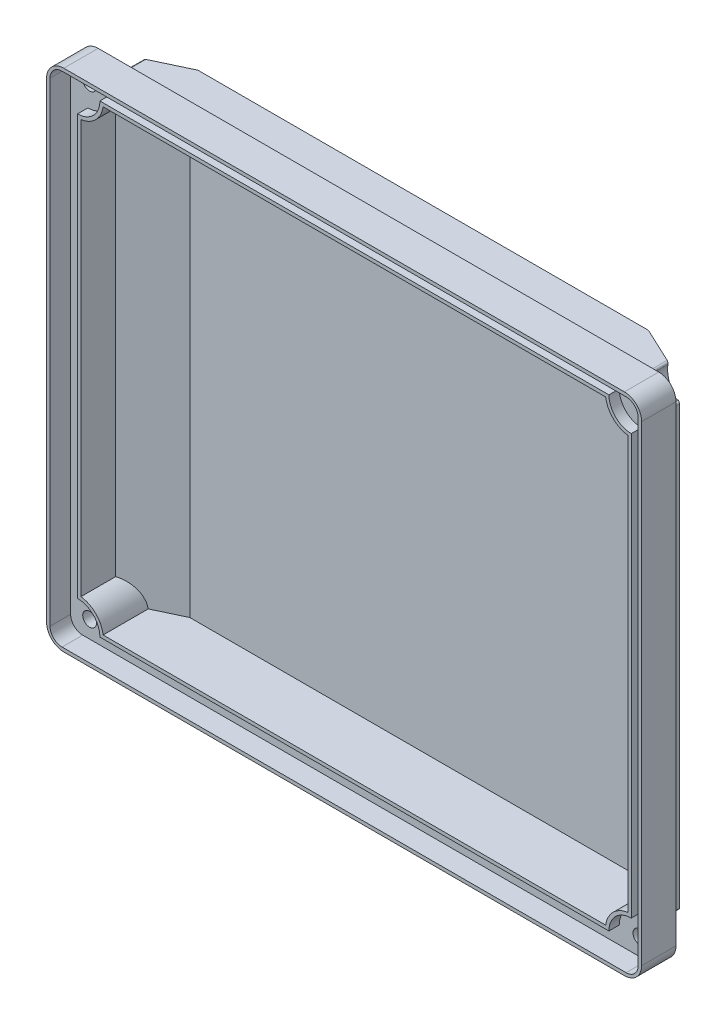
ISO-10303-21;
HEADER;
FILE_DESCRIPTION(('STEP AP214'),'2;1');
FILE_NAME('part.step','',(''),(''),'','','');
FILE_SCHEMA(('AUTOMOTIVE_DESIGN { 1 0 10303 214 1 1 1 1 }'));
ENDSEC;
DATA;
#1=APPLICATION_CONTEXT('core data for automotive mechanical design processes');
#2=APPLICATION_PROTOCOL_DEFINITION('international standard','automotive_design',2000,#1);
#3=PRODUCT_CONTEXT('',#1,'mechanical');
#4=PRODUCT('Part','Part','',(#3));
#5=PRODUCT_RELATED_PRODUCT_CATEGORY('part','',(#4));
#6=PRODUCT_DEFINITION_FORMATION('','',#4);
#7=PRODUCT_DEFINITION_CONTEXT('part definition',#1,'design');
#8=PRODUCT_DEFINITION('design','',#6,#7);
#9=PRODUCT_DEFINITION_SHAPE('','',#8);
#10=(LENGTH_UNIT() NAMED_UNIT(*) SI_UNIT(.MILLI.,.METRE.));
#11=(NAMED_UNIT(*) PLANE_ANGLE_UNIT() SI_UNIT($,.RADIAN.));
#12=(NAMED_UNIT(*) SI_UNIT($,.STERADIAN.) SOLID_ANGLE_UNIT());
#13=UNCERTAINTY_MEASURE_WITH_UNIT(LENGTH_MEASURE(1.E-05),#10,'distance_accuracy_value','');
#14=(GEOMETRIC_REPRESENTATION_CONTEXT(3) GLOBAL_UNCERTAINTY_ASSIGNED_CONTEXT((#13)) GLOBAL_UNIT_ASSIGNED_CONTEXT((#10,
#11,#12)) REPRESENTATION_CONTEXT('',''));
#15=CARTESIAN_POINT('',(0.,0.,0.));
#16=DIRECTION('',(0.,0.,1.));
#17=DIRECTION('',(1.,0.,0.));
#18=AXIS2_PLACEMENT_3D('',#15,#16,#17);
#19=CARTESIAN_POINT('',(0.,0.,0.));
#20=DIRECTION('',(0.,0.,-1.));
#21=DIRECTION('',(-1.,0.,0.));
#22=AXIS2_PLACEMENT_3D('',#19,#20,#21);
#23=PLANE('',#22);
#24=DIRECTION('',(-1.,0.,0.));
#25=VECTOR('',#24,1.);
#26=CARTESIAN_POINT('',(-86.5,73.5,0.));
#27=LINE('',#26,#25);
#28=CARTESIAN_POINT('',(81.5,73.5,0.));
#29=VERTEX_POINT('',#28);
#30=CARTESIAN_POINT('',(-81.5,73.5,0.));
#31=VERTEX_POINT('',#30);
#32=EDGE_CURVE('E818',#29,#31,#27,.T.);
#33=ORIENTED_EDGE('',*,*,#32,.F.);
#34=CARTESIAN_POINT('',(81.5,68.5,0.));
#35=DIRECTION('',(0.,0.,-1.));
#36=DIRECTION('',(-1.,0.,0.));
#37=AXIS2_PLACEMENT_3D('',#34,#35,#36);
#38=CIRCLE('',#37,5.);
#39=CARTESIAN_POINT('',(86.5,68.5,0.));
#40=VERTEX_POINT('',#39);
#41=EDGE_CURVE('E875',#29,#40,#38,.T.);
#42=ORIENTED_EDGE('',*,*,#41,.T.);
#43=DIRECTION('',(0.,1.,0.));
#44=VECTOR('',#43,1.);
#45=CARTESIAN_POINT('',(86.5,-73.5,0.));
#46=LINE('',#45,#44);
#47=CARTESIAN_POINT('',(86.5,-68.5,0.));
#48=VERTEX_POINT('',#47);
#49=EDGE_CURVE('E801',#48,#40,#46,.T.);
#50=ORIENTED_EDGE('',*,*,#49,.F.);
#51=CARTESIAN_POINT('',(81.5,-68.5,0.));
#52=DIRECTION('',(0.,0.,-1.));
#53=DIRECTION('',(-1.,0.,0.));
#54=AXIS2_PLACEMENT_3D('',#51,#52,#53);
#55=CIRCLE('',#54,5.);
#56=CARTESIAN_POINT('',(81.5,-73.5,0.));
#57=VERTEX_POINT('',#56);
#58=EDGE_CURVE('E873',#48,#57,#55,.T.);
#59=ORIENTED_EDGE('',*,*,#58,.T.);
#60=DIRECTION('',(1.,0.,0.));
#61=VECTOR('',#60,1.);
#62=CARTESIAN_POINT('',(-86.5,-73.5,0.));
#63=LINE('',#62,#61);
#64=CARTESIAN_POINT('',(-81.5,-73.5,0.));
#65=VERTEX_POINT('',#64);
#66=EDGE_CURVE('E806',#65,#57,#63,.T.);
#67=ORIENTED_EDGE('',*,*,#66,.F.);
#68=CARTESIAN_POINT('',(-81.5,-68.5,0.));
#69=DIRECTION('',(0.,0.,-1.));
#70=DIRECTION('',(-1.,0.,0.));
#71=AXIS2_PLACEMENT_3D('',#68,#69,#70);
#72=CIRCLE('',#71,5.);
#73=CARTESIAN_POINT('',(-86.5,-68.5,0.));
#74=VERTEX_POINT('',#73);
#75=EDGE_CURVE('E871',#65,#74,#72,.T.);
#76=ORIENTED_EDGE('',*,*,#75,.T.);
#77=DIRECTION('',(0.,-1.,0.));
#78=VECTOR('',#77,1.);
#79=CARTESIAN_POINT('',(-86.5,-73.5,0.));
#80=LINE('',#79,#78);
#81=CARTESIAN_POINT('',(-86.5,68.5,0.));
#82=VERTEX_POINT('',#81);
#83=EDGE_CURVE('E821',#82,#74,#80,.T.);
#84=ORIENTED_EDGE('',*,*,#83,.F.);
#85=CARTESIAN_POINT('',(-81.5,68.5,0.));
#86=DIRECTION('',(0.,0.,-1.));
#87=DIRECTION('',(-1.,0.,0.));
#88=AXIS2_PLACEMENT_3D('',#85,#86,#87);
#89=CIRCLE('',#88,5.);
#90=EDGE_CURVE('E869',#82,#31,#89,.T.);
#91=ORIENTED_EDGE('',*,*,#90,.T.);
#92=EDGE_LOOP('',(#33,#42,#50,#59,#67,#76,#84,#91));
#93=FACE_BOUND('',#92,.T.);
#94=CARTESIAN_POINT('',(-80.,67.4999999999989,0.));
#95=DIRECTION('',(0.,0.,-1.));
#96=DIRECTION('',(-1.,0.,0.));
#97=AXIS2_PLACEMENT_3D('',#94,#95,#96);
#98=CIRCLE('',#97,2.);
#99=CARTESIAN_POINT('',(-82.,67.4999999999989,0.));
#100=VERTEX_POINT('',#99);
#101=EDGE_CURVE('E692',#100,#100,#98,.T.);
#102=ORIENTED_EDGE('',*,*,#101,.F.);
#103=EDGE_LOOP('',(#102));
#104=FACE_BOUND('',#103,.T.);
#105=CARTESIAN_POINT('',(80.,67.5,0.));
#106=DIRECTION('',(0.,0.,-1.));
#107=DIRECTION('',(-1.,0.,0.));
#108=AXIS2_PLACEMENT_3D('',#105,#106,#107);
#109=CIRCLE('',#108,2.);
#110=CARTESIAN_POINT('',(78.,67.5,0.));
#111=VERTEX_POINT('',#110);
#112=EDGE_CURVE('E689',#111,#111,#109,.T.);
#113=ORIENTED_EDGE('',*,*,#112,.F.);
#114=EDGE_LOOP('',(#113));
#115=FACE_BOUND('',#114,.T.);
#116=CARTESIAN_POINT('',(-79.9999999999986,-67.5000000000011,0.));
#117=DIRECTION('',(0.,0.,-1.));
#118=DIRECTION('',(-1.,0.,0.));
#119=AXIS2_PLACEMENT_3D('',#116,#117,#118);
#120=CIRCLE('',#119,2.);
#121=CARTESIAN_POINT('',(-81.9999999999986,-67.5000000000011,0.));
#122=VERTEX_POINT('',#121);
#123=EDGE_CURVE('E695',#122,#122,#120,.T.);
#124=ORIENTED_EDGE('',*,*,#123,.F.);
#125=EDGE_LOOP('',(#124));
#126=FACE_BOUND('',#125,.T.);
#127=CARTESIAN_POINT('',(80.0000000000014,-67.5,0.));
#128=DIRECTION('',(0.,0.,-1.));
#129=DIRECTION('',(-1.,0.,0.));
#130=AXIS2_PLACEMENT_3D('',#127,#128,#129);
#131=CIRCLE('',#130,2.);
#132=CARTESIAN_POINT('',(78.0000000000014,-67.5,0.));
#133=VERTEX_POINT('',#132);
#134=EDGE_CURVE('E698',#133,#133,#131,.T.);
#135=ORIENTED_EDGE('',*,*,#134,.F.);
#136=EDGE_LOOP('',(#135));
#137=FACE_BOUND('',#136,.T.);
#138=CARTESIAN_POINT('',(-79.9999999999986,-67.5000000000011,0.));
#139=DIRECTION('',(0.,0.,1.));
#140=DIRECTION('',(-1.,0.,0.));
#141=AXIS2_PLACEMENT_3D('',#138,#139,#140);
#142=CIRCLE('',#141,4.00000000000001);
#143=CARTESIAN_POINT('',(-76.22876383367,-68.8333333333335,0.));
#144=VERTEX_POINT('',#143);
#145=CARTESIAN_POINT('',(-81.7777777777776,-63.9167743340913,0.));
#146=VERTEX_POINT('',#145);
#147=EDGE_CURVE('E603',#144,#146,#142,.T.);
#148=ORIENTED_EDGE('',*,*,#147,.F.);
#149=CARTESIAN_POINT('',(-75.7573593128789,-69.,0.));
#150=DIRECTION('',(0.,0.,-1.));
#151=DIRECTION('',(-1.,0.,0.));
#152=AXIS2_PLACEMENT_3D('',#149,#150,#151);
#153=CIRCLE('',#152,0.499999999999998);
#154=CARTESIAN_POINT('',(-75.7573593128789,-69.5,0.));
#155=VERTEX_POINT('',#154);
#156=EDGE_CURVE('E592',#155,#144,#153,.T.);
#157=ORIENTED_EDGE('',*,*,#156,.F.);
#158=DIRECTION('',(-1.,0.,0.));
#159=VECTOR('',#158,1.);
#160=CARTESIAN_POINT('',(75.7573593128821,-69.5,0.));
#161=LINE('',#160,#159);
#162=CARTESIAN_POINT('',(75.7573593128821,-69.5,0.));
#163=VERTEX_POINT('',#162);
#164=EDGE_CURVE('E597',#163,#155,#161,.T.);
#165=ORIENTED_EDGE('',*,*,#164,.F.);
#166=CARTESIAN_POINT('',(75.7573593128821,-69.,0.));
#167=DIRECTION('',(0.,0.,-1.));
#168=DIRECTION('',(1.,0.,0.));
#169=AXIS2_PLACEMENT_3D('',#166,#167,#168);
#170=CIRCLE('',#169,0.499999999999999);
#171=CARTESIAN_POINT('',(76.2287638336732,-68.8333333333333,0.));
#172=VERTEX_POINT('',#171);
#173=EDGE_CURVE('E642',#172,#163,#170,.T.);
#174=ORIENTED_EDGE('',*,*,#173,.F.);
#175=CARTESIAN_POINT('',(80.0000000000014,-67.5,0.));
#176=DIRECTION('',(0.,0.,1.));
#177=DIRECTION('',(-1.,0.,0.));
#178=AXIS2_PLACEMENT_3D('',#175,#176,#177);
#179=CIRCLE('',#178,4.00000000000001);
#180=CARTESIAN_POINT('',(81.7777777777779,-63.9167743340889,0.));
#181=VERTEX_POINT('',#180);
#182=EDGE_CURVE('E639',#181,#172,#179,.T.);
#183=ORIENTED_EDGE('',*,*,#182,.F.);
#184=CARTESIAN_POINT('',(82.,-63.46887112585,0.));
#185=DIRECTION('',(0.,0.,-1.));
#186=DIRECTION('',(1.,0.,0.));
#187=AXIS2_PLACEMENT_3D('',#184,#185,#186);
#188=CIRCLE('',#187,0.499999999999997);
#189=CARTESIAN_POINT('',(82.5,-63.46887112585,0.));
#190=VERTEX_POINT('',#189);
#191=EDGE_CURVE('E636',#190,#181,#188,.T.);
#192=ORIENTED_EDGE('',*,*,#191,.F.);
#193=DIRECTION('',(0.,-1.,0.));
#194=VECTOR('',#193,1.);
#195=CARTESIAN_POINT('',(82.5,63.4688711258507,0.));
#196=LINE('',#195,#194);
#197=CARTESIAN_POINT('',(82.5,63.4688711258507,0.));
#198=VERTEX_POINT('',#197);
#199=EDGE_CURVE('E633',#198,#190,#196,.T.);
#200=ORIENTED_EDGE('',*,*,#199,.F.);
#201=CARTESIAN_POINT('',(82.,63.4688711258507,0.));
#202=DIRECTION('',(0.,0.,-1.));
#203=DIRECTION('',(1.,0.,0.));
#204=AXIS2_PLACEMENT_3D('',#201,#202,#203);
#205=CIRCLE('',#204,0.500000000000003);
#206=CARTESIAN_POINT('',(81.7777777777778,63.9167743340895,0.));
#207=VERTEX_POINT('',#206);
#208=EDGE_CURVE('E630',#207,#198,#205,.T.);
#209=ORIENTED_EDGE('',*,*,#208,.F.);
#210=CARTESIAN_POINT('',(80.,67.5,0.));
#211=DIRECTION('',(0.,0.,1.));
#212=DIRECTION('',(-1.,0.,0.));
#213=AXIS2_PLACEMENT_3D('',#210,#211,#212);
#214=CIRCLE('',#213,4.);
#215=CARTESIAN_POINT('',(76.2287638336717,68.8333333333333,0.));
#216=VERTEX_POINT('',#215);
#217=EDGE_CURVE('E627',#216,#207,#214,.T.);
#218=ORIENTED_EDGE('',*,*,#217,.F.);
#219=CARTESIAN_POINT('',(75.7573593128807,69.,0.));
#220=DIRECTION('',(0.,0.,-1.));
#221=DIRECTION('',(-1.,0.,0.));
#222=AXIS2_PLACEMENT_3D('',#219,#220,#221);
#223=CIRCLE('',#222,0.499999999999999);
#224=CARTESIAN_POINT('',(75.7573593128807,69.5,0.));
#225=VERTEX_POINT('',#224);
#226=EDGE_CURVE('E624',#225,#216,#223,.T.);
#227=ORIENTED_EDGE('',*,*,#226,.F.);
#228=DIRECTION('',(1.,0.,0.));
#229=VECTOR('',#228,1.);
#230=CARTESIAN_POINT('',(-75.7573593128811,69.5,0.));
#231=LINE('',#230,#229);
#232=CARTESIAN_POINT('',(-75.7573593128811,69.5,0.));
#233=VERTEX_POINT('',#232);
#234=EDGE_CURVE('E621',#233,#225,#231,.T.);
#235=ORIENTED_EDGE('',*,*,#234,.F.);
#236=CARTESIAN_POINT('',(-75.7573593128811,69.,0.));
#237=DIRECTION('',(0.,0.,-1.));
#238=DIRECTION('',(-1.,0.,0.));
#239=AXIS2_PLACEMENT_3D('',#236,#237,#238);
#240=CIRCLE('',#239,0.5);
#241=CARTESIAN_POINT('',(-76.2287638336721,68.8333333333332,0.));
#242=VERTEX_POINT('',#241);
#243=EDGE_CURVE('E618',#242,#233,#240,.T.);
#244=ORIENTED_EDGE('',*,*,#243,.F.);
#245=CARTESIAN_POINT('',(-80.,67.4999999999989,0.));
#246=DIRECTION('',(0.,0.,1.));
#247=DIRECTION('',(-1.,0.,0.));
#248=AXIS2_PLACEMENT_3D('',#245,#246,#247);
#249=CIRCLE('',#248,4.00000000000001);
#250=CARTESIAN_POINT('',(-81.7777777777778,63.9167743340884,0.));
#251=VERTEX_POINT('',#250);
#252=EDGE_CURVE('E615',#251,#242,#249,.T.);
#253=ORIENTED_EDGE('',*,*,#252,.F.);
#254=CARTESIAN_POINT('',(-82.,63.4688711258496,0.));
#255=DIRECTION('',(0.,0.,-1.));
#256=DIRECTION('',(-1.,0.,0.));
#257=AXIS2_PLACEMENT_3D('',#254,#255,#256);
#258=CIRCLE('',#257,0.500000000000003);
#259=CARTESIAN_POINT('',(-82.5,63.4688711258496,0.));
#260=VERTEX_POINT('',#259);
#261=EDGE_CURVE('E612',#260,#251,#258,.T.);
#262=ORIENTED_EDGE('',*,*,#261,.F.);
#263=DIRECTION('',(0.,1.,0.));
#264=VECTOR('',#263,1.);
#265=CARTESIAN_POINT('',(-82.5,-63.4688711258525,0.));
#266=LINE('',#265,#264);
#267=CARTESIAN_POINT('',(-82.5,-63.4688711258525,0.));
#268=VERTEX_POINT('',#267);
#269=EDGE_CURVE('E609',#268,#260,#266,.T.);
#270=ORIENTED_EDGE('',*,*,#269,.F.);
#271=CARTESIAN_POINT('',(-82.,-63.4688711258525,0.));
#272=DIRECTION('',(0.,0.,-1.));
#273=DIRECTION('',(1.,0.,0.));
#274=AXIS2_PLACEMENT_3D('',#271,#272,#273);
#275=CIRCLE('',#274,0.499999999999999);
#276=EDGE_CURVE('E606',#146,#268,#275,.T.);
#277=ORIENTED_EDGE('',*,*,#276,.F.);
#278=EDGE_LOOP('',(#148,#157,#165,#174,#183,#192,#200,#209,#218,#227,#235,#244,#253,#262,#270,#277));
#279=FACE_BOUND('',#278,.T.);
#280=ADVANCED_FACE('F37',(#93,#104,#115,#126,#137,#279),#23,.T.);
#281=CARTESIAN_POINT('',(80.5,-67.5,-210.109495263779));
#282=DIRECTION('',(0.,0.,1.));
#283=DIRECTION('',(1.,0.,0.));
#284=AXIS2_PLACEMENT_3D('',#281,#282,#283);
#285=CYLINDRICAL_SURFACE('',#284,6.50000000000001);
#286=DIRECTION('',(0.,0.,1.));
#287=VECTOR('',#286,1.);
#288=CARTESIAN_POINT('',(74.,-67.5,-210.109495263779));
#289=LINE('',#288,#287);
#290=CARTESIAN_POINT('',(74.,-67.4999999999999,4.));
#291=VERTEX_POINT('',#290);
#292=CARTESIAN_POINT('',(74.,-67.5,7.));
#293=VERTEX_POINT('',#292);
#294=EDGE_CURVE('E744',#291,#293,#289,.T.);
#295=ORIENTED_EDGE('',*,*,#294,.F.);
#296=CARTESIAN_POINT('',(80.5,-67.4999999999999,4.));
#297=DIRECTION('',(0.,0.,1.));
#298=DIRECTION('',(-1.,0.,0.));
#299=AXIS2_PLACEMENT_3D('',#296,#297,#298);
#300=CIRCLE('',#299,6.49999999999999);
#301=CARTESIAN_POINT('',(80.5,-60.9999999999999,4.));
#302=VERTEX_POINT('',#301);
#303=EDGE_CURVE('E678',#302,#291,#300,.T.);
#304=ORIENTED_EDGE('',*,*,#303,.F.);
#305=DIRECTION('',(0.,0.,1.));
#306=VECTOR('',#305,1.);
#307=CARTESIAN_POINT('',(80.5,-61.,-210.109495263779));
#308=LINE('',#307,#306);
#309=CARTESIAN_POINT('',(80.5,-61.,7.));
#310=VERTEX_POINT('',#309);
#311=EDGE_CURVE('E743',#302,#310,#308,.T.);
#312=ORIENTED_EDGE('',*,*,#311,.T.);
#313=CARTESIAN_POINT('',(80.5,-67.5,7.));
#314=DIRECTION('',(0.,0.,-1.));
#315=DIRECTION('',(1.,0.,0.));
#316=AXIS2_PLACEMENT_3D('',#313,#314,#315);
#317=CIRCLE('',#316,6.50000000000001);
#318=EDGE_CURVE('E719',#293,#310,#317,.T.);
#319=ORIENTED_EDGE('',*,*,#318,.F.);
#320=EDGE_LOOP('',(#295,#304,#312,#319));
#321=FACE_BOUND('',#320,.T.);
#322=ADVANCED_FACE('F413',(#321),#285,.F.);
#323=CARTESIAN_POINT('',(-80.5,67.5,-210.109495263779));
#324=DIRECTION('',(0.,0.,1.));
#325=DIRECTION('',(1.,0.,0.));
#326=AXIS2_PLACEMENT_3D('',#323,#324,#325);
#327=CYLINDRICAL_SURFACE('',#326,6.50000000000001);
#328=DIRECTION('',(0.,0.,1.));
#329=VECTOR('',#328,1.);
#330=CARTESIAN_POINT('',(-74.,67.5,-210.109495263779));
#331=LINE('',#330,#329);
#332=CARTESIAN_POINT('',(-74.,67.5,4.));
#333=VERTEX_POINT('',#332);
#334=CARTESIAN_POINT('',(-74.,67.5,7.));
#335=VERTEX_POINT('',#334);
#336=EDGE_CURVE('E752',#333,#335,#331,.T.);
#337=ORIENTED_EDGE('',*,*,#336,.F.);
#338=CARTESIAN_POINT('',(-80.5,67.5,4.));
#339=DIRECTION('',(0.,0.,1.));
#340=DIRECTION('',(-1.,0.,0.));
#341=AXIS2_PLACEMENT_3D('',#338,#339,#340);
#342=CIRCLE('',#341,6.50000000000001);
#343=CARTESIAN_POINT('',(-80.5,61.,4.));
#344=VERTEX_POINT('',#343);
#345=EDGE_CURVE('E684',#344,#333,#342,.T.);
#346=ORIENTED_EDGE('',*,*,#345,.F.);
#347=DIRECTION('',(0.,0.,1.));
#348=VECTOR('',#347,1.);
#349=CARTESIAN_POINT('',(-80.5,61.,-210.109495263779));
#350=LINE('',#349,#348);
#351=CARTESIAN_POINT('',(-80.5,61.,7.));
#352=VERTEX_POINT('',#351);
#353=EDGE_CURVE('E750',#344,#352,#350,.T.);
#354=ORIENTED_EDGE('',*,*,#353,.T.);
#355=CARTESIAN_POINT('',(-80.5,67.5,7.));
#356=DIRECTION('',(0.,0.,-1.));
#357=DIRECTION('',(1.,0.,0.));
#358=AXIS2_PLACEMENT_3D('',#355,#356,#357);
#359=CIRCLE('',#358,6.50000000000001);
#360=EDGE_CURVE('E731',#335,#352,#359,.T.);
#361=ORIENTED_EDGE('',*,*,#360,.F.);
#362=EDGE_LOOP('',(#337,#346,#354,#361));
#363=FACE_BOUND('',#362,.T.);
#364=ADVANCED_FACE('F419',(#363),#327,.F.);
#365=CARTESIAN_POINT('',(0.,0.,10.));
#366=DIRECTION('',(0.,0.,-1.));
#367=DIRECTION('',(-1.,0.,0.));
#368=AXIS2_PLACEMENT_3D('',#365,#366,#367);
#369=PLANE('',#368);
#370=DIRECTION('',(-1.,0.,0.));
#371=VECTOR('',#370,1.);
#372=CARTESIAN_POINT('',(85.5,72.5,10.));
#373=LINE('',#372,#371);
#374=CARTESIAN_POINT('',(82.,72.5,10.));
#375=VERTEX_POINT('',#374);
#376=CARTESIAN_POINT('',(-81.9999999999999,72.5,10.));
#377=VERTEX_POINT('',#376);
#378=EDGE_CURVE('E785',#375,#377,#373,.T.);
#379=ORIENTED_EDGE('',*,*,#378,.F.);
#380=CARTESIAN_POINT('',(82.,69.,10.));
#381=DIRECTION('',(0.,0.,-1.));
#382=DIRECTION('',(-1.,0.,0.));
#383=AXIS2_PLACEMENT_3D('',#380,#381,#382);
#384=CIRCLE('',#383,3.5);
#385=CARTESIAN_POINT('',(85.5,69.,10.));
#386=VERTEX_POINT('',#385);
#387=EDGE_CURVE('E860',#375,#386,#384,.T.);
#388=ORIENTED_EDGE('',*,*,#387,.T.);
#389=DIRECTION('',(0.,1.,0.));
#390=VECTOR('',#389,1.);
#391=CARTESIAN_POINT('',(85.5,-72.5,10.));
#392=LINE('',#391,#390);
#393=CARTESIAN_POINT('',(85.5,-69.,10.));
#394=VERTEX_POINT('',#393);
#395=EDGE_CURVE('E768',#394,#386,#392,.T.);
#396=ORIENTED_EDGE('',*,*,#395,.F.);
#397=CARTESIAN_POINT('',(82.,-69.,10.));
#398=DIRECTION('',(0.,0.,-1.));
#399=DIRECTION('',(-1.,0.,0.));
#400=AXIS2_PLACEMENT_3D('',#397,#398,#399);
#401=CIRCLE('',#400,3.5);
#402=CARTESIAN_POINT('',(81.9999999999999,-72.5,10.));
#403=VERTEX_POINT('',#402);
#404=EDGE_CURVE('E858',#394,#403,#401,.T.);
#405=ORIENTED_EDGE('',*,*,#404,.T.);
#406=DIRECTION('',(1.,0.,0.));
#407=VECTOR('',#406,1.);
#408=CARTESIAN_POINT('',(-85.5,-72.5,10.));
#409=LINE('',#408,#407);
#410=CARTESIAN_POINT('',(-82.,-72.5,10.));
#411=VERTEX_POINT('',#410);
#412=EDGE_CURVE('E773',#411,#403,#409,.T.);
#413=ORIENTED_EDGE('',*,*,#412,.F.);
#414=CARTESIAN_POINT('',(-82.,-69.,10.));
#415=DIRECTION('',(0.,0.,-1.));
#416=DIRECTION('',(-1.,0.,0.));
#417=AXIS2_PLACEMENT_3D('',#414,#415,#416);
#418=CIRCLE('',#417,3.5);
#419=CARTESIAN_POINT('',(-85.5,-69.,10.));
#420=VERTEX_POINT('',#419);
#421=EDGE_CURVE('E856',#411,#420,#418,.T.);
#422=ORIENTED_EDGE('',*,*,#421,.T.);
#423=DIRECTION('',(0.,-1.,0.));
#424=VECTOR('',#423,1.);
#425=CARTESIAN_POINT('',(-85.5,72.5,10.));
#426=LINE('',#425,#424);
#427=CARTESIAN_POINT('',(-85.5,69.,10.));
#428=VERTEX_POINT('',#427);
#429=EDGE_CURVE('E788',#428,#420,#426,.T.);
#430=ORIENTED_EDGE('',*,*,#429,.F.);
#431=CARTESIAN_POINT('',(-82.,69.,10.));
#432=DIRECTION('',(0.,0.,-1.));
#433=DIRECTION('',(-1.,0.,0.));
#434=AXIS2_PLACEMENT_3D('',#431,#432,#433);
#435=CIRCLE('',#434,3.5);
#436=EDGE_CURVE('E862',#428,#377,#435,.T.);
#437=ORIENTED_EDGE('',*,*,#436,.T.);
#438=EDGE_LOOP('',(#379,#388,#396,#405,#413,#422,#430,#437));
#439=FACE_BOUND('',#438,.T.);
#440=DIRECTION('',(0.,1.,0.));
#441=VECTOR('',#440,1.);
#442=CARTESIAN_POINT('',(86.5,-73.5,10.));
#443=LINE('',#442,#441);
#444=CARTESIAN_POINT('',(86.5,-68.5,10.));
#445=VERTEX_POINT('',#444);
#446=CARTESIAN_POINT('',(86.5,68.5,10.));
#447=VERTEX_POINT('',#446);
#448=EDGE_CURVE('E802',#445,#447,#443,.T.);
#449=ORIENTED_EDGE('',*,*,#448,.T.);
#450=CARTESIAN_POINT('',(81.5,68.5,10.));
#451=DIRECTION('',(0.,0.,-1.));
#452=DIRECTION('',(-1.,0.,0.));
#453=AXIS2_PLACEMENT_3D('',#450,#451,#452);
#454=CIRCLE('',#453,5.);
#455=CARTESIAN_POINT('',(81.5,73.5,10.));
#456=VERTEX_POINT('',#455);
#457=EDGE_CURVE('E888',#447,#456,#454,.F.);
#458=ORIENTED_EDGE('',*,*,#457,.T.);
#459=DIRECTION('',(-1.,0.,0.));
#460=VECTOR('',#459,1.);
#461=CARTESIAN_POINT('',(-86.5,73.5,10.));
#462=LINE('',#461,#460);
#463=CARTESIAN_POINT('',(-81.5,73.5,10.));
#464=VERTEX_POINT('',#463);
#465=EDGE_CURVE('E805',#456,#464,#462,.T.);
#466=ORIENTED_EDGE('',*,*,#465,.T.);
#467=CARTESIAN_POINT('',(-81.5,68.5,10.));
#468=DIRECTION('',(0.,0.,-1.));
#469=DIRECTION('',(-1.,0.,0.));
#470=AXIS2_PLACEMENT_3D('',#467,#468,#469);
#471=CIRCLE('',#470,5.);
#472=CARTESIAN_POINT('',(-86.5,68.5,10.));
#473=VERTEX_POINT('',#472);
#474=EDGE_CURVE('E882',#464,#473,#471,.F.);
#475=ORIENTED_EDGE('',*,*,#474,.T.);
#476=DIRECTION('',(0.,-1.,0.));
#477=VECTOR('',#476,1.);
#478=CARTESIAN_POINT('',(-86.5,-73.5,10.));
#479=LINE('',#478,#477);
#480=CARTESIAN_POINT('',(-86.5,-68.5,10.));
#481=VERTEX_POINT('',#480);
#482=EDGE_CURVE('E809',#473,#481,#479,.T.);
#483=ORIENTED_EDGE('',*,*,#482,.T.);
#484=CARTESIAN_POINT('',(-81.5,-68.5,10.));
#485=DIRECTION('',(0.,0.,-1.));
#486=DIRECTION('',(-1.,0.,0.));
#487=AXIS2_PLACEMENT_3D('',#484,#485,#486);
#488=CIRCLE('',#487,5.);
#489=CARTESIAN_POINT('',(-81.5,-73.5,10.));
#490=VERTEX_POINT('',#489);
#491=EDGE_CURVE('E884',#481,#490,#488,.F.);
#492=ORIENTED_EDGE('',*,*,#491,.T.);
#493=DIRECTION('',(1.,0.,0.));
#494=VECTOR('',#493,1.);
#495=CARTESIAN_POINT('',(-86.5,-73.5,10.));
#496=LINE('',#495,#494);
#497=CARTESIAN_POINT('',(81.5,-73.5,10.));
#498=VERTEX_POINT('',#497);
#499=EDGE_CURVE('E812',#490,#498,#496,.T.);
#500=ORIENTED_EDGE('',*,*,#499,.T.);
#501=CARTESIAN_POINT('',(81.5,-68.5,10.));
#502=DIRECTION('',(0.,0.,-1.));
#503=DIRECTION('',(-1.,0.,0.));
#504=AXIS2_PLACEMENT_3D('',#501,#502,#503);
#505=CIRCLE('',#504,5.);
#506=EDGE_CURVE('E886',#498,#445,#505,.F.);
#507=ORIENTED_EDGE('',*,*,#506,.T.);
#508=EDGE_LOOP('',(#449,#458,#466,#475,#483,#492,#500,#507));
#509=FACE_BOUND('',#508,.T.);
#510=ADVANCED_FACE('F426',(#439,#509),#369,.F.);
#511=CARTESIAN_POINT('',(86.5,-73.5,10.));
#512=DIRECTION('',(-1.,0.,0.));
#513=DIRECTION('',(0.,0.,1.));
#514=AXIS2_PLACEMENT_3D('',#511,#512,#513);
#515=PLANE('',#514);
#516=ORIENTED_EDGE('',*,*,#49,.T.);
#517=DIRECTION('',(0.,0.,-1.));
#518=VECTOR('',#517,1.);
#519=CARTESIAN_POINT('',(86.5,68.5,10.));
#520=LINE('',#519,#518);
#521=EDGE_CURVE('E880',#40,#447,#520,.F.);
#522=ORIENTED_EDGE('',*,*,#521,.T.);
#523=ORIENTED_EDGE('',*,*,#448,.F.);
#524=DIRECTION('',(0.,0.,-1.));
#525=VECTOR('',#524,1.);
#526=CARTESIAN_POINT('',(86.5,-68.5,10.));
#527=LINE('',#526,#525);
#528=EDGE_CURVE('E877',#445,#48,#527,.T.);
#529=ORIENTED_EDGE('',*,*,#528,.T.);
#530=EDGE_LOOP('',(#516,#522,#523,#529));
#531=FACE_BOUND('',#530,.T.);
#532=ADVANCED_FACE('F440',(#531),#515,.F.);
#533=CARTESIAN_POINT('',(-86.5,73.5,10.));
#534=DIRECTION('',(0.,-1.,0.));
#535=DIRECTION('',(0.,0.,-1.));
#536=AXIS2_PLACEMENT_3D('',#533,#534,#535);
#537=PLANE('',#536);
#538=ORIENTED_EDGE('',*,*,#465,.F.);
#539=DIRECTION('',(0.,0.,-1.));
#540=VECTOR('',#539,1.);
#541=CARTESIAN_POINT('',(81.5,73.5,10.));
#542=LINE('',#541,#540);
#543=EDGE_CURVE('E866',#456,#29,#542,.T.);
#544=ORIENTED_EDGE('',*,*,#543,.T.);
#545=ORIENTED_EDGE('',*,*,#32,.T.);
#546=DIRECTION('',(0.,0.,-1.));
#547=VECTOR('',#546,1.);
#548=CARTESIAN_POINT('',(-81.5,73.5,10.));
#549=LINE('',#548,#547);
#550=EDGE_CURVE('E864',#31,#464,#549,.F.);
#551=ORIENTED_EDGE('',*,*,#550,.T.);
#552=EDGE_LOOP('',(#538,#544,#545,#551));
#553=FACE_BOUND('',#552,.T.);
#554=ADVANCED_FACE('F436',(#553),#537,.F.);
#555=CARTESIAN_POINT('',(-86.5,-73.5,10.));
#556=DIRECTION('',(1.,0.,0.));
#557=DIRECTION('',(0.,0.,-1.));
#558=AXIS2_PLACEMENT_3D('',#555,#556,#557);
#559=PLANE('',#558);
#560=ORIENTED_EDGE('',*,*,#83,.T.);
#561=DIRECTION('',(0.,0.,-1.));
#562=VECTOR('',#561,1.);
#563=CARTESIAN_POINT('',(-86.5,-68.5,10.));
#564=LINE('',#563,#562);
#565=EDGE_CURVE('E898',#74,#481,#564,.F.);
#566=ORIENTED_EDGE('',*,*,#565,.T.);
#567=ORIENTED_EDGE('',*,*,#482,.F.);
#568=DIRECTION('',(0.,0.,-1.));
#569=VECTOR('',#568,1.);
#570=CARTESIAN_POINT('',(-86.5,68.5,10.));
#571=LINE('',#570,#569);
#572=EDGE_CURVE('E895',#473,#82,#571,.T.);
#573=ORIENTED_EDGE('',*,*,#572,.T.);
#574=EDGE_LOOP('',(#560,#566,#567,#573));
#575=FACE_BOUND('',#574,.T.);
#576=ADVANCED_FACE('F432',(#575),#559,.F.);
#577=CARTESIAN_POINT('',(-86.5,-73.5,10.));
#578=DIRECTION('',(0.,1.,0.));
#579=DIRECTION('',(0.,0.,1.));
#580=AXIS2_PLACEMENT_3D('',#577,#578,#579);
#581=PLANE('',#580);
#582=ORIENTED_EDGE('',*,*,#66,.T.);
#583=DIRECTION('',(0.,0.,-1.));
#584=VECTOR('',#583,1.);
#585=CARTESIAN_POINT('',(81.5,-73.5,10.));
#586=LINE('',#585,#584);
#587=EDGE_CURVE('E893',#57,#498,#586,.F.);
#588=ORIENTED_EDGE('',*,*,#587,.T.);
#589=ORIENTED_EDGE('',*,*,#499,.F.);
#590=DIRECTION('',(0.,0.,-1.));
#591=VECTOR('',#590,1.);
#592=CARTESIAN_POINT('',(-81.5,-73.5,10.));
#593=LINE('',#592,#591);
#594=EDGE_CURVE('E890',#490,#65,#593,.T.);
#595=ORIENTED_EDGE('',*,*,#594,.T.);
#596=EDGE_LOOP('',(#582,#588,#589,#595));
#597=FACE_BOUND('',#596,.T.);
#598=ADVANCED_FACE('F428',(#597),#581,.F.);
#599=CARTESIAN_POINT('',(85.5,-72.5,4.));
#600=DIRECTION('',(1.,0.,0.));
#601=DIRECTION('',(0.,0.,-1.));
#602=AXIS2_PLACEMENT_3D('',#599,#600,#601);
#603=PLANE('',#602);
#604=DIRECTION('',(0.,1.,0.));
#605=VECTOR('',#604,1.);
#606=CARTESIAN_POINT('',(85.5,-72.5,4.));
#607=LINE('',#606,#605);
#608=CARTESIAN_POINT('',(85.5,-69.,4.));
#609=VERTEX_POINT('',#608);
#610=CARTESIAN_POINT('',(85.5,69.,4.));
#611=VERTEX_POINT('',#610);
#612=EDGE_CURVE('E769',#609,#611,#607,.T.);
#613=ORIENTED_EDGE('',*,*,#612,.F.);
#614=DIRECTION('',(0.,0.,1.));
#615=VECTOR('',#614,1.);
#616=CARTESIAN_POINT('',(85.5,-69.,10.));
#617=LINE('',#616,#615);
#618=EDGE_CURVE('E848',#609,#394,#617,.T.);
#619=ORIENTED_EDGE('',*,*,#618,.T.);
#620=ORIENTED_EDGE('',*,*,#395,.T.);
#621=DIRECTION('',(0.,0.,1.));
#622=VECTOR('',#621,1.);
#623=CARTESIAN_POINT('',(85.5,69.,4.));
#624=LINE('',#623,#622);
#625=EDGE_CURVE('E846',#386,#611,#624,.F.);
#626=ORIENTED_EDGE('',*,*,#625,.T.);
#627=EDGE_LOOP('',(#613,#619,#620,#626));
#628=FACE_BOUND('',#627,.T.);
#629=ADVANCED_FACE('F431',(#628),#603,.F.);
#630=CARTESIAN_POINT('',(-85.5,-72.5,4.));
#631=DIRECTION('',(0.,-1.,0.));
#632=DIRECTION('',(0.,0.,-1.));
#633=AXIS2_PLACEMENT_3D('',#630,#631,#632);
#634=PLANE('',#633);
#635=DIRECTION('',(1.,0.,0.));
#636=VECTOR('',#635,1.);
#637=CARTESIAN_POINT('',(-85.5,-72.5,4.));
#638=LINE('',#637,#636);
#639=CARTESIAN_POINT('',(-82.,-72.5,4.));
#640=VERTEX_POINT('',#639);
#641=CARTESIAN_POINT('',(81.9999999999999,-72.5,4.));
#642=VERTEX_POINT('',#641);
#643=EDGE_CURVE('E779',#640,#642,#638,.T.);
#644=ORIENTED_EDGE('',*,*,#643,.F.);
#645=DIRECTION('',(0.,0.,1.));
#646=VECTOR('',#645,1.);
#647=CARTESIAN_POINT('',(-82.,-72.5,10.));
#648=LINE('',#647,#646);
#649=EDGE_CURVE('E830',#640,#411,#648,.T.);
#650=ORIENTED_EDGE('',*,*,#649,.T.);
#651=ORIENTED_EDGE('',*,*,#412,.T.);
#652=DIRECTION('',(0.,0.,1.));
#653=VECTOR('',#652,1.);
#654=CARTESIAN_POINT('',(82.,-72.5,4.));
#655=LINE('',#654,#653);
#656=EDGE_CURVE('E828',#403,#642,#655,.F.);
#657=ORIENTED_EDGE('',*,*,#656,.T.);
#658=EDGE_LOOP('',(#644,#650,#651,#657));
#659=FACE_BOUND('',#658,.T.);
#660=ADVANCED_FACE('F1109',(#659),#634,.F.);
#661=CARTESIAN_POINT('',(-85.5,72.5,4.));
#662=DIRECTION('',(-1.,0.,0.));
#663=DIRECTION('',(0.,0.,1.));
#664=AXIS2_PLACEMENT_3D('',#661,#662,#663);
#665=PLANE('',#664);
#666=ORIENTED_EDGE('',*,*,#429,.T.);
#667=DIRECTION('',(0.,0.,1.));
#668=VECTOR('',#667,1.);
#669=CARTESIAN_POINT('',(-85.5,-69.,4.));
#670=LINE('',#669,#668);
#671=CARTESIAN_POINT('',(-85.5,-69.,4.));
#672=VERTEX_POINT('',#671);
#673=EDGE_CURVE('E836',#420,#672,#670,.F.);
#674=ORIENTED_EDGE('',*,*,#673,.T.);
#675=DIRECTION('',(0.,-1.,0.));
#676=VECTOR('',#675,1.);
#677=CARTESIAN_POINT('',(-85.5,72.5,4.));
#678=LINE('',#677,#676);
#679=CARTESIAN_POINT('',(-85.5,69.,4.));
#680=VERTEX_POINT('',#679);
#681=EDGE_CURVE('E776',#680,#672,#678,.T.);
#682=ORIENTED_EDGE('',*,*,#681,.F.);
#683=DIRECTION('',(0.,0.,1.));
#684=VECTOR('',#683,1.);
#685=CARTESIAN_POINT('',(-85.5,69.,10.));
#686=LINE('',#685,#684);
#687=EDGE_CURVE('E833',#680,#428,#686,.T.);
#688=ORIENTED_EDGE('',*,*,#687,.T.);
#689=EDGE_LOOP('',(#666,#674,#682,#688));
#690=FACE_BOUND('',#689,.T.);
#691=ADVANCED_FACE('F1126',(#690),#665,.F.);
#692=CARTESIAN_POINT('',(85.5,72.5,4.));
#693=DIRECTION('',(0.,1.,0.));
#694=DIRECTION('',(0.,0.,1.));
#695=AXIS2_PLACEMENT_3D('',#692,#693,#694);
#696=PLANE('',#695);
#697=DIRECTION('',(-1.,0.,0.));
#698=VECTOR('',#697,1.);
#699=CARTESIAN_POINT('',(85.5,72.5,4.));
#700=LINE('',#699,#698);
#701=CARTESIAN_POINT('',(82.,72.5,4.));
#702=VERTEX_POINT('',#701);
#703=CARTESIAN_POINT('',(-81.9999999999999,72.5,4.));
#704=VERTEX_POINT('',#703);
#705=EDGE_CURVE('E772',#702,#704,#700,.T.);
#706=ORIENTED_EDGE('',*,*,#705,.F.);
#707=DIRECTION('',(0.,0.,1.));
#708=VECTOR('',#707,1.);
#709=CARTESIAN_POINT('',(82.,72.5,10.));
#710=LINE('',#709,#708);
#711=EDGE_CURVE('E853',#702,#375,#710,.T.);
#712=ORIENTED_EDGE('',*,*,#711,.T.);
#713=ORIENTED_EDGE('',*,*,#378,.T.);
#714=DIRECTION('',(0.,0.,1.));
#715=VECTOR('',#714,1.);
#716=CARTESIAN_POINT('',(-82.,72.5,4.));
#717=LINE('',#716,#715);
#718=EDGE_CURVE('E851',#377,#704,#717,.F.);
#719=ORIENTED_EDGE('',*,*,#718,.T.);
#720=EDGE_LOOP('',(#706,#712,#713,#719));
#721=FACE_BOUND('',#720,.T.);
#722=ADVANCED_FACE('F1073',(#721),#696,.F.);
#723=CARTESIAN_POINT('',(0.,0.,4.));
#724=DIRECTION('',(0.,0.,1.));
#725=DIRECTION('',(1.,0.,0.));
#726=AXIS2_PLACEMENT_3D('',#723,#724,#725);
#727=PLANE('',#726);
#728=CARTESIAN_POINT('',(80.0000000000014,-67.5,4.));
#729=DIRECTION('',(0.,0.,1.));
#730=DIRECTION('',(1.,0.,0.));
#731=AXIS2_PLACEMENT_3D('',#728,#729,#730);
#732=CIRCLE('',#731,2.);
#733=CARTESIAN_POINT('',(82.0000000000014,-67.5,4.));
#734=VERTEX_POINT('',#733);
#735=EDGE_CURVE('E906',#734,#734,#732,.T.);
#736=ORIENTED_EDGE('',*,*,#735,.F.);
#737=EDGE_LOOP('',(#736));
#738=FACE_BOUND('',#737,.T.);
#739=CARTESIAN_POINT('',(-79.9999999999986,-67.5000000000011,4.));
#740=DIRECTION('',(0.,0.,1.));
#741=DIRECTION('',(1.,0.,0.));
#742=AXIS2_PLACEMENT_3D('',#739,#740,#741);
#743=CIRCLE('',#742,2.);
#744=CARTESIAN_POINT('',(-77.9999999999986,-67.5000000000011,4.));
#745=VERTEX_POINT('',#744);
#746=EDGE_CURVE('E903',#745,#745,#743,.T.);
#747=ORIENTED_EDGE('',*,*,#746,.F.);
#748=EDGE_LOOP('',(#747));
#749=FACE_BOUND('',#748,.T.);
#750=CARTESIAN_POINT('',(80.,67.5,4.));
#751=DIRECTION('',(0.,0.,1.));
#752=DIRECTION('',(1.,0.,0.));
#753=AXIS2_PLACEMENT_3D('',#750,#751,#752);
#754=CIRCLE('',#753,2.);
#755=CARTESIAN_POINT('',(82.,67.5,4.));
#756=VERTEX_POINT('',#755);
#757=EDGE_CURVE('E900',#756,#756,#754,.T.);
#758=ORIENTED_EDGE('',*,*,#757,.F.);
#759=EDGE_LOOP('',(#758));
#760=FACE_BOUND('',#759,.T.);
#761=CARTESIAN_POINT('',(-80.,67.4999999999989,4.));
#762=DIRECTION('',(0.,0.,1.));
#763=DIRECTION('',(1.,0.,0.));
#764=AXIS2_PLACEMENT_3D('',#761,#762,#763);
#765=CIRCLE('',#764,2.);
#766=CARTESIAN_POINT('',(-78.,67.4999999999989,4.));
#767=VERTEX_POINT('',#766);
#768=EDGE_CURVE('E686',#767,#767,#765,.T.);
#769=ORIENTED_EDGE('',*,*,#768,.F.);
#770=EDGE_LOOP('',(#769));
#771=FACE_BOUND('',#770,.T.);
#772=ORIENTED_EDGE('',*,*,#303,.T.);
#773=DIRECTION('',(1.,0.,0.));
#774=VECTOR('',#773,1.);
#775=CARTESIAN_POINT('',(-80.5,-67.5,4.));
#776=LINE('',#775,#774);
#777=CARTESIAN_POINT('',(-74.,-67.5,4.));
#778=VERTEX_POINT('',#777);
#779=EDGE_CURVE('E795',#778,#291,#776,.T.);
#780=ORIENTED_EDGE('',*,*,#779,.F.);
#781=CARTESIAN_POINT('',(-80.5,-67.5,4.));
#782=DIRECTION('',(0.,0.,1.));
#783=DIRECTION('',(1.,0.,0.));
#784=AXIS2_PLACEMENT_3D('',#781,#782,#783);
#785=CIRCLE('',#784,6.50000000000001);
#786=CARTESIAN_POINT('',(-80.5,-61.,4.));
#787=VERTEX_POINT('',#786);
#788=EDGE_CURVE('E680',#778,#787,#785,.T.);
#789=ORIENTED_EDGE('',*,*,#788,.T.);
#790=DIRECTION('',(0.,-1.,0.));
#791=VECTOR('',#790,1.);
#792=CARTESIAN_POINT('',(-80.5,-67.5,4.));
#793=LINE('',#792,#791);
#794=EDGE_CURVE('E798',#344,#787,#793,.T.);
#795=ORIENTED_EDGE('',*,*,#794,.F.);
#796=ORIENTED_EDGE('',*,*,#345,.T.);
#797=DIRECTION('',(-1.,0.,0.));
#798=VECTOR('',#797,1.);
#799=CARTESIAN_POINT('',(-80.5,67.5,4.));
#800=LINE('',#799,#798);
#801=CARTESIAN_POINT('',(74.,67.4999999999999,4.));
#802=VERTEX_POINT('',#801);
#803=EDGE_CURVE('E815',#802,#333,#800,.T.);
#804=ORIENTED_EDGE('',*,*,#803,.F.);
#805=CARTESIAN_POINT('',(80.5,67.4999999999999,4.));
#806=DIRECTION('',(0.,0.,1.));
#807=DIRECTION('',(1.,0.,0.));
#808=AXIS2_PLACEMENT_3D('',#805,#806,#807);
#809=CIRCLE('',#808,6.49999999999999);
#810=CARTESIAN_POINT('',(80.5,60.9999999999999,4.));
#811=VERTEX_POINT('',#810);
#812=EDGE_CURVE('E682',#802,#811,#809,.T.);
#813=ORIENTED_EDGE('',*,*,#812,.T.);
#814=DIRECTION('',(0.,1.,0.));
#815=VECTOR('',#814,1.);
#816=CARTESIAN_POINT('',(80.5,-67.5,4.));
#817=LINE('',#816,#815);
#818=EDGE_CURVE('E782',#302,#811,#817,.T.);
#819=ORIENTED_EDGE('',*,*,#818,.F.);
#820=EDGE_LOOP('',(#772,#780,#789,#795,#796,#804,#813,#819));
#821=FACE_BOUND('',#820,.T.);
#822=ORIENTED_EDGE('',*,*,#681,.T.);
#823=CARTESIAN_POINT('',(-82.,-69.,4.));
#824=DIRECTION('',(0.,0.,1.));
#825=DIRECTION('',(1.,0.,0.));
#826=AXIS2_PLACEMENT_3D('',#823,#824,#825);
#827=CIRCLE('',#826,3.5);
#828=EDGE_CURVE('E844',#672,#640,#827,.T.);
#829=ORIENTED_EDGE('',*,*,#828,.T.);
#830=ORIENTED_EDGE('',*,*,#643,.T.);
#831=CARTESIAN_POINT('',(82.,-69.,4.));
#832=DIRECTION('',(0.,0.,1.));
#833=DIRECTION('',(1.,0.,0.));
#834=AXIS2_PLACEMENT_3D('',#831,#832,#833);
#835=CIRCLE('',#834,3.5);
#836=EDGE_CURVE('E842',#642,#609,#835,.T.);
#837=ORIENTED_EDGE('',*,*,#836,.T.);
#838=ORIENTED_EDGE('',*,*,#612,.T.);
#839=CARTESIAN_POINT('',(82.,69.,4.));
#840=DIRECTION('',(0.,0.,1.));
#841=DIRECTION('',(1.,0.,0.));
#842=AXIS2_PLACEMENT_3D('',#839,#840,#841);
#843=CIRCLE('',#842,3.5);
#844=EDGE_CURVE('E840',#611,#702,#843,.T.);
#845=ORIENTED_EDGE('',*,*,#844,.T.);
#846=ORIENTED_EDGE('',*,*,#705,.T.);
#847=CARTESIAN_POINT('',(-82.,69.,4.));
#848=DIRECTION('',(0.,0.,1.));
#849=DIRECTION('',(1.,0.,0.));
#850=AXIS2_PLACEMENT_3D('',#847,#848,#849);
#851=CIRCLE('',#850,3.5);
#852=EDGE_CURVE('E838',#704,#680,#851,.T.);
#853=ORIENTED_EDGE('',*,*,#852,.T.);
#854=EDGE_LOOP('',(#822,#829,#830,#837,#838,#845,#846,#853));
#855=FACE_BOUND('',#854,.T.);
#856=ADVANCED_FACE('F1068',(#738,#749,#760,#771,#821,#855),#727,.T.);
#857=CARTESIAN_POINT('',(74.,-67.5,-210.109495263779));
#858=DIRECTION('',(0.,-1.,0.));
#859=DIRECTION('',(0.,0.,-1.));
#860=AXIS2_PLACEMENT_3D('',#857,#858,#859);
#861=PLANE('',#860);
#862=DIRECTION('',(0.,0.,1.));
#863=VECTOR('',#862,1.);
#864=CARTESIAN_POINT('',(-74.,-67.5,-210.109495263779));
#865=LINE('',#864,#863);
#866=CARTESIAN_POINT('',(-74.,-67.5,7.));
#867=VERTEX_POINT('',#866);
#868=EDGE_CURVE('E746',#778,#867,#865,.T.);
#869=ORIENTED_EDGE('',*,*,#868,.F.);
#870=ORIENTED_EDGE('',*,*,#779,.T.);
#871=ORIENTED_EDGE('',*,*,#294,.T.);
#872=DIRECTION('',(1.,0.,0.));
#873=VECTOR('',#872,1.);
#874=CARTESIAN_POINT('',(74.,-67.5,7.));
#875=LINE('',#874,#873);
#876=EDGE_CURVE('E740',#867,#293,#875,.T.);
#877=ORIENTED_EDGE('',*,*,#876,.F.);
#878=EDGE_LOOP('',(#869,#870,#871,#877));
#879=FACE_BOUND('',#878,.T.);
#880=ADVANCED_FACE('F1065',(#879),#861,.T.);
#881=CARTESIAN_POINT('',(-80.5,-67.5,-210.109495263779));
#882=DIRECTION('',(0.,0.,1.));
#883=DIRECTION('',(1.,0.,0.));
#884=AXIS2_PLACEMENT_3D('',#881,#882,#883);
#885=CYLINDRICAL_SURFACE('',#884,6.50000000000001);
#886=ORIENTED_EDGE('',*,*,#788,.F.);
#887=ORIENTED_EDGE('',*,*,#868,.T.);
#888=CARTESIAN_POINT('',(-80.5,-67.5,7.));
#889=DIRECTION('',(0.,0.,-1.));
#890=DIRECTION('',(-1.,0.,0.));
#891=AXIS2_PLACEMENT_3D('',#888,#889,#890);
#892=CIRCLE('',#891,6.50000000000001);
#893=CARTESIAN_POINT('',(-80.5,-61.,7.));
#894=VERTEX_POINT('',#893);
#895=EDGE_CURVE('E737',#894,#867,#892,.T.);
#896=ORIENTED_EDGE('',*,*,#895,.F.);
#897=DIRECTION('',(0.,0.,1.));
#898=VECTOR('',#897,1.);
#899=CARTESIAN_POINT('',(-80.5,-61.,-210.109495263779));
#900=LINE('',#899,#898);
#901=EDGE_CURVE('E748',#787,#894,#900,.T.);
#902=ORIENTED_EDGE('',*,*,#901,.F.);
#903=EDGE_LOOP('',(#886,#887,#896,#902));
#904=FACE_BOUND('',#903,.T.);
#905=ADVANCED_FACE('F1061',(#904),#885,.F.);
#906=CARTESIAN_POINT('',(-80.5,-61.,-210.109495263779));
#907=DIRECTION('',(-1.,0.,0.));
#908=DIRECTION('',(0.,0.,1.));
#909=AXIS2_PLACEMENT_3D('',#906,#907,#908);
#910=PLANE('',#909);
#911=ORIENTED_EDGE('',*,*,#353,.F.);
#912=ORIENTED_EDGE('',*,*,#794,.T.);
#913=ORIENTED_EDGE('',*,*,#901,.T.);
#914=DIRECTION('',(0.,-1.,0.));
#915=VECTOR('',#914,1.);
#916=CARTESIAN_POINT('',(-80.5,-61.,7.));
#917=LINE('',#916,#915);
#918=EDGE_CURVE('E734',#352,#894,#917,.T.);
#919=ORIENTED_EDGE('',*,*,#918,.F.);
#920=EDGE_LOOP('',(#911,#912,#913,#919));
#921=FACE_BOUND('',#920,.T.);
#922=ADVANCED_FACE('F1054',(#921),#910,.T.);
#923=CARTESIAN_POINT('',(-74.,67.5,-210.109495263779));
#924=DIRECTION('',(0.,1.,0.));
#925=DIRECTION('',(0.,0.,1.));
#926=AXIS2_PLACEMENT_3D('',#923,#924,#925);
#927=PLANE('',#926);
#928=DIRECTION('',(0.,0.,1.));
#929=VECTOR('',#928,1.);
#930=CARTESIAN_POINT('',(74.,67.5,-210.109495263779));
#931=LINE('',#930,#929);
#932=CARTESIAN_POINT('',(74.,67.5,7.));
#933=VERTEX_POINT('',#932);
#934=EDGE_CURVE('E754',#802,#933,#931,.T.);
#935=ORIENTED_EDGE('',*,*,#934,.F.);
#936=ORIENTED_EDGE('',*,*,#803,.T.);
#937=ORIENTED_EDGE('',*,*,#336,.T.);
#938=DIRECTION('',(-1.,0.,0.));
#939=VECTOR('',#938,1.);
#940=CARTESIAN_POINT('',(-74.,67.5,7.));
#941=LINE('',#940,#939);
#942=EDGE_CURVE('E728',#933,#335,#941,.T.);
#943=ORIENTED_EDGE('',*,*,#942,.F.);
#944=EDGE_LOOP('',(#935,#936,#937,#943));
#945=FACE_BOUND('',#944,.T.);
#946=ADVANCED_FACE('F1050',(#945),#927,.T.);
#947=CARTESIAN_POINT('',(80.5,67.5,-210.109495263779));
#948=DIRECTION('',(0.,0.,1.));
#949=DIRECTION('',(1.,0.,0.));
#950=AXIS2_PLACEMENT_3D('',#947,#948,#949);
#951=CYLINDRICAL_SURFACE('',#950,6.50000000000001);
#952=ORIENTED_EDGE('',*,*,#812,.F.);
#953=ORIENTED_EDGE('',*,*,#934,.T.);
#954=CARTESIAN_POINT('',(80.5,67.5,7.));
#955=DIRECTION('',(0.,0.,-1.));
#956=DIRECTION('',(-1.,0.,0.));
#957=AXIS2_PLACEMENT_3D('',#954,#955,#956);
#958=CIRCLE('',#957,6.50000000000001);
#959=CARTESIAN_POINT('',(80.5,61.,7.));
#960=VERTEX_POINT('',#959);
#961=EDGE_CURVE('E725',#960,#933,#958,.T.);
#962=ORIENTED_EDGE('',*,*,#961,.F.);
#963=DIRECTION('',(0.,0.,1.));
#964=VECTOR('',#963,1.);
#965=CARTESIAN_POINT('',(80.5,61.,-210.109495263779));
#966=LINE('',#965,#964);
#967=EDGE_CURVE('E756',#811,#960,#966,.T.);
#968=ORIENTED_EDGE('',*,*,#967,.F.);
#969=EDGE_LOOP('',(#952,#953,#962,#968));
#970=FACE_BOUND('',#969,.T.);
#971=ADVANCED_FACE('F1046',(#970),#951,.F.);
#972=CARTESIAN_POINT('',(80.5,61.,-210.109495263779));
#973=DIRECTION('',(1.,0.,0.));
#974=DIRECTION('',(0.,0.,-1.));
#975=AXIS2_PLACEMENT_3D('',#972,#973,#974);
#976=PLANE('',#975);
#977=ORIENTED_EDGE('',*,*,#311,.F.);
#978=ORIENTED_EDGE('',*,*,#818,.T.);
#979=ORIENTED_EDGE('',*,*,#967,.T.);
#980=DIRECTION('',(0.,1.,0.));
#981=VECTOR('',#980,1.);
#982=CARTESIAN_POINT('',(80.5,61.,7.));
#983=LINE('',#982,#981);
#984=EDGE_CURVE('E722',#310,#960,#983,.T.);
#985=ORIENTED_EDGE('',*,*,#984,.F.);
#986=EDGE_LOOP('',(#977,#978,#979,#985));
#987=FACE_BOUND('',#986,.T.);
#988=ADVANCED_FACE('F1042',(#987),#976,.T.);
#989=CARTESIAN_POINT('',(-80.5,67.5,-210.109495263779));
#990=DIRECTION('',(0.,0.,1.));
#991=DIRECTION('',(1.,0.,0.));
#992=AXIS2_PLACEMENT_3D('',#989,#990,#991);
#993=CYLINDRICAL_SURFACE('',#992,7.50000000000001);
#994=DIRECTION('',(0.,0.,1.));
#995=VECTOR('',#994,1.);
#996=CARTESIAN_POINT('',(-79.5,60.0669656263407,-210.109495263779));
#997=LINE('',#996,#995);
#998=CARTESIAN_POINT('',(-79.5,60.0669656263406,-3.09618337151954));
#999=VERTEX_POINT('',#998);
#1000=CARTESIAN_POINT('',(-79.5,60.0669656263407,7.));
#1001=VERTEX_POINT('',#1000);
#1002=EDGE_CURVE('E386',#999,#1001,#997,.T.);
#1003=ORIENTED_EDGE('',*,*,#1002,.F.);
#1004=CARTESIAN_POINT('',(-80.5,67.5,-2.62559513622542));
#1005=DIRECTION('',(0.42579703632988,0.,0.904818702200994));
#1006=DIRECTION('',(-0.904818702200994,0.,0.42579703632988));
#1007=AXIS2_PLACEMENT_3D('',#1004,#1005,#1006);
#1008=ELLIPSE('',#1007,8.28895333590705,7.50000000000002);
#1009=CARTESIAN_POINT('',(-73.0669656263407,66.5,-6.12349366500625));
#1010=VERTEX_POINT('',#1009);
#1011=EDGE_CURVE('E395',#999,#1010,#1008,.T.);
#1012=ORIENTED_EDGE('',*,*,#1011,.T.);
#1013=DIRECTION('',(0.,0.,1.));
#1014=VECTOR('',#1013,1.);
#1015=CARTESIAN_POINT('',(-73.0669656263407,66.5,-210.109495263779));
#1016=LINE('',#1015,#1014);
#1017=CARTESIAN_POINT('',(-73.0669656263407,66.5,7.));
#1018=VERTEX_POINT('',#1017);
#1019=EDGE_CURVE('E758',#1010,#1018,#1016,.T.);
#1020=ORIENTED_EDGE('',*,*,#1019,.T.);
#1021=CARTESIAN_POINT('',(-80.5,67.5,7.));
#1022=DIRECTION('',(0.,0.,-1.));
#1023=DIRECTION('',(1.,0.,0.));
#1024=AXIS2_PLACEMENT_3D('',#1021,#1022,#1023);
#1025=CIRCLE('',#1024,7.50000000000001);
#1026=EDGE_CURVE('E701',#1018,#1001,#1025,.T.);
#1027=ORIENTED_EDGE('',*,*,#1026,.T.);
#1028=EDGE_LOOP('',(#1003,#1012,#1020,#1027));
#1029=FACE_BOUND('',#1028,.T.);
#1030=ADVANCED_FACE('F1045',(#1029),#993,.T.);
#1031=CARTESIAN_POINT('',(-73.0669656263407,66.5,-210.109495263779));
#1032=DIRECTION('',(0.,1.,0.));
#1033=DIRECTION('',(0.,0.,1.));
#1034=AXIS2_PLACEMENT_3D('',#1031,#1032,#1033);
#1035=PLANE('',#1034);
#1036=DIRECTION('',(-0.904818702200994,0.,-0.42579703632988));
#1037=VECTOR('',#1036,1.);
#1038=CARTESIAN_POINT('',(-51.4243509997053,66.5,-64.7076426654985));
#1039=LINE('',#1038,#1037);
#1040=CARTESIAN_POINT('',(73.0669656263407,66.5,-6.12349366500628));
#1041=VERTEX_POINT('',#1040);
#1042=CARTESIAN_POINT('',(64.829389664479,66.5,-10.));
#1043=VERTEX_POINT('',#1042);
#1044=EDGE_CURVE('E396',#1041,#1043,#1039,.T.);
#1045=ORIENTED_EDGE('',*,*,#1044,.F.);
#1046=DIRECTION('',(0.,0.,1.));
#1047=VECTOR('',#1046,1.);
#1048=CARTESIAN_POINT('',(73.0669656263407,66.5,-210.109495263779));
#1049=LINE('',#1048,#1047);
#1050=CARTESIAN_POINT('',(73.0669656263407,66.5,7.));
#1051=VERTEX_POINT('',#1050);
#1052=EDGE_CURVE('E761',#1041,#1051,#1049,.T.);
#1053=ORIENTED_EDGE('',*,*,#1052,.T.);
#1054=DIRECTION('',(-1.,0.,0.));
#1055=VECTOR('',#1054,1.);
#1056=CARTESIAN_POINT('',(-73.0669656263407,66.5,7.));
#1057=LINE('',#1056,#1055);
#1058=EDGE_CURVE('E716',#1051,#1018,#1057,.T.);
#1059=ORIENTED_EDGE('',*,*,#1058,.T.);
#1060=ORIENTED_EDGE('',*,*,#1019,.F.);
#1061=DIRECTION('',(-0.904818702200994,0.,0.42579703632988));
#1062=VECTOR('',#1061,1.);
#1063=CARTESIAN_POINT('',(-72.6202769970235,66.5,-6.3337000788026));
#1064=LINE('',#1063,#1062);
#1065=CARTESIAN_POINT('',(-64.829389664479,66.5,-10.));
#1066=VERTEX_POINT('',#1065);
#1067=EDGE_CURVE('E532',#1066,#1010,#1064,.T.);
#1068=ORIENTED_EDGE('',*,*,#1067,.F.);
#1069=DIRECTION('',(1.,0.,0.));
#1070=VECTOR('',#1069,1.);
#1071=CARTESIAN_POINT('',(-75.7573593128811,66.5,-10.));
#1072=LINE('',#1071,#1070);
#1073=EDGE_CURVE('E536',#1066,#1043,#1072,.T.);
#1074=ORIENTED_EDGE('',*,*,#1073,.T.);
#1075=EDGE_LOOP('',(#1045,#1053,#1059,#1060,#1068,#1074));
#1076=FACE_BOUND('',#1075,.T.);
#1077=ADVANCED_FACE('F1466',(#1076),#1035,.F.);
#1078=CARTESIAN_POINT('',(80.5,67.5,-210.109495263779));
#1079=DIRECTION('',(0.,0.,1.));
#1080=DIRECTION('',(1.,0.,0.));
#1081=AXIS2_PLACEMENT_3D('',#1078,#1079,#1080);
#1082=CYLINDRICAL_SURFACE('',#1081,7.49999999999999);
#1083=ORIENTED_EDGE('',*,*,#1052,.F.);
#1084=CARTESIAN_POINT('',(80.5,67.5,-2.62559513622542));
#1085=DIRECTION('',(-0.42579703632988,0.,0.904818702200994));
#1086=DIRECTION('',(0.904818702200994,0.,0.42579703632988));
#1087=AXIS2_PLACEMENT_3D('',#1084,#1085,#1086);
#1088=ELLIPSE('',#1087,8.28895333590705,7.50000000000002);
#1089=CARTESIAN_POINT('',(79.5,60.0669656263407,-3.09618337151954));
#1090=VERTEX_POINT('',#1089);
#1091=EDGE_CURVE('E510',#1041,#1090,#1088,.T.);
#1092=ORIENTED_EDGE('',*,*,#1091,.T.);
#1093=DIRECTION('',(0.,0.,1.));
#1094=VECTOR('',#1093,1.);
#1095=CARTESIAN_POINT('',(79.5,60.0669656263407,-210.109495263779));
#1096=LINE('',#1095,#1094);
#1097=CARTESIAN_POINT('',(79.5,60.0669656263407,7.));
#1098=VERTEX_POINT('',#1097);
#1099=EDGE_CURVE('E526',#1090,#1098,#1096,.T.);
#1100=ORIENTED_EDGE('',*,*,#1099,.T.);
#1101=CARTESIAN_POINT('',(80.5,67.5,7.));
#1102=DIRECTION('',(0.,0.,-1.));
#1103=DIRECTION('',(-1.,0.,0.));
#1104=AXIS2_PLACEMENT_3D('',#1101,#1102,#1103);
#1105=CIRCLE('',#1104,7.49999999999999);
#1106=EDGE_CURVE('E713',#1098,#1051,#1105,.T.);
#1107=ORIENTED_EDGE('',*,*,#1106,.T.);
#1108=EDGE_LOOP('',(#1083,#1092,#1100,#1107));
#1109=FACE_BOUND('',#1108,.T.);
#1110=ADVANCED_FACE('F1478',(#1109),#1082,.T.);
#1111=CARTESIAN_POINT('',(79.5,60.0669656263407,-210.109495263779));
#1112=DIRECTION('',(1.,0.,0.));
#1113=DIRECTION('',(0.,0.,-1.));
#1114=AXIS2_PLACEMENT_3D('',#1111,#1112,#1113);
#1115=PLANE('',#1114);
#1116=DIRECTION('',(0.,-1.,0.));
#1117=VECTOR('',#1116,1.);
#1118=CARTESIAN_POINT('',(79.5,73.5,-3.09618337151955));
#1119=LINE('',#1118,#1117);
#1120=CARTESIAN_POINT('',(79.5,-60.0669656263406,-3.09618337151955));
#1121=VERTEX_POINT('',#1120);
#1122=EDGE_CURVE('E520',#1090,#1121,#1119,.T.);
#1123=ORIENTED_EDGE('',*,*,#1122,.T.);
#1124=DIRECTION('',(0.,0.,1.));
#1125=VECTOR('',#1124,1.);
#1126=CARTESIAN_POINT('',(79.5,-60.0669656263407,-210.109495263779));
#1127=LINE('',#1126,#1125);
#1128=CARTESIAN_POINT('',(79.5,-60.0669656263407,7.));
#1129=VERTEX_POINT('',#1128);
#1130=EDGE_CURVE('E59',#1121,#1129,#1127,.T.);
#1131=ORIENTED_EDGE('',*,*,#1130,.T.);
#1132=DIRECTION('',(0.,1.,0.));
#1133=VECTOR('',#1132,1.);
#1134=CARTESIAN_POINT('',(79.5,60.0669656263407,7.));
#1135=LINE('',#1134,#1133);
#1136=EDGE_CURVE('E711',#1129,#1098,#1135,.T.);
#1137=ORIENTED_EDGE('',*,*,#1136,.T.);
#1138=ORIENTED_EDGE('',*,*,#1099,.F.);
#1139=EDGE_LOOP('',(#1123,#1131,#1137,#1138));
#1140=FACE_BOUND('',#1139,.T.);
#1141=ADVANCED_FACE('F524',(#1140),#1115,.F.);
#1142=CARTESIAN_POINT('',(80.5,-67.5,-210.109495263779));
#1143=DIRECTION('',(0.,0.,1.));
#1144=DIRECTION('',(1.,0.,0.));
#1145=AXIS2_PLACEMENT_3D('',#1142,#1143,#1144);
#1146=CYLINDRICAL_SURFACE('',#1145,7.50000000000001);
#1147=ORIENTED_EDGE('',*,*,#1130,.F.);
#1148=CARTESIAN_POINT('',(80.5,-67.5,-2.62559513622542));
#1149=DIRECTION('',(-0.42579703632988,0.,0.904818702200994));
#1150=DIRECTION('',(0.904818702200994,0.,0.42579703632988));
#1151=AXIS2_PLACEMENT_3D('',#1148,#1149,#1150);
#1152=ELLIPSE('',#1151,8.28895333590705,7.50000000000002);
#1153=CARTESIAN_POINT('',(73.0669656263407,-66.5,-6.12349366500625));
#1154=VERTEX_POINT('',#1153);
#1155=EDGE_CURVE('E45',#1121,#1154,#1152,.T.);
#1156=ORIENTED_EDGE('',*,*,#1155,.T.);
#1157=DIRECTION('',(0.,0.,1.));
#1158=VECTOR('',#1157,1.);
#1159=CARTESIAN_POINT('',(73.0669656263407,-66.5,-210.109495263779));
#1160=LINE('',#1159,#1158);
#1161=CARTESIAN_POINT('',(73.0669656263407,-66.5,7.));
#1162=VERTEX_POINT('',#1161);
#1163=EDGE_CURVE('E512',#1154,#1162,#1160,.T.);
#1164=ORIENTED_EDGE('',*,*,#1163,.T.);
#1165=CARTESIAN_POINT('',(80.5,-67.5,7.));
#1166=DIRECTION('',(0.,0.,-1.));
#1167=DIRECTION('',(1.,0.,0.));
#1168=AXIS2_PLACEMENT_3D('',#1165,#1166,#1167);
#1169=CIRCLE('',#1168,7.50000000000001);
#1170=EDGE_CURVE('E709',#1162,#1129,#1169,.T.);
#1171=ORIENTED_EDGE('',*,*,#1170,.T.);
#1172=EDGE_LOOP('',(#1147,#1156,#1164,#1171));
#1173=FACE_BOUND('',#1172,.T.);
#1174=ADVANCED_FACE('F409',(#1173),#1146,.T.);
#1175=CARTESIAN_POINT('',(73.0669656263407,-66.5,-210.109495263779));
#1176=DIRECTION('',(0.,-1.,0.));
#1177=DIRECTION('',(0.,0.,-1.));
#1178=AXIS2_PLACEMENT_3D('',#1175,#1176,#1177);
#1179=PLANE('',#1178);
#1180=DIRECTION('',(-0.904818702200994,0.,0.42579703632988));
#1181=VECTOR('',#1180,1.);
#1182=CARTESIAN_POINT('',(-81.2226088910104,-66.5,-2.28554389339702));
#1183=LINE('',#1182,#1181);
#1184=CARTESIAN_POINT('',(-64.829389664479,-66.5,-10.));
#1185=VERTEX_POINT('',#1184);
#1186=CARTESIAN_POINT('',(-73.0669656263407,-66.5,-6.12349366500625));
#1187=VERTEX_POINT('',#1186);
#1188=EDGE_CURVE('E397',#1185,#1187,#1183,.T.);
#1189=ORIENTED_EDGE('',*,*,#1188,.T.);
#1190=DIRECTION('',(0.,0.,1.));
#1191=VECTOR('',#1190,1.);
#1192=CARTESIAN_POINT('',(-73.0669656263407,-66.5,-210.109495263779));
#1193=LINE('',#1192,#1191);
#1194=CARTESIAN_POINT('',(-73.0669656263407,-66.5,7.));
#1195=VERTEX_POINT('',#1194);
#1196=EDGE_CURVE('E51',#1187,#1195,#1193,.T.);
#1197=ORIENTED_EDGE('',*,*,#1196,.T.);
#1198=DIRECTION('',(1.,0.,0.));
#1199=VECTOR('',#1198,1.);
#1200=CARTESIAN_POINT('',(73.0669656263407,-66.5,7.));
#1201=LINE('',#1200,#1199);
#1202=EDGE_CURVE('E707',#1195,#1162,#1201,.T.);
#1203=ORIENTED_EDGE('',*,*,#1202,.T.);
#1204=ORIENTED_EDGE('',*,*,#1163,.F.);
#1205=DIRECTION('',(-0.904818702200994,0.,-0.42579703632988));
#1206=VECTOR('',#1205,1.);
#1207=CARTESIAN_POINT('',(81.2226088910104,-66.5,-2.28554389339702));
#1208=LINE('',#1207,#1206);
#1209=CARTESIAN_POINT('',(64.829389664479,-66.5,-10.));
#1210=VERTEX_POINT('',#1209);
#1211=EDGE_CURVE('E522',#1154,#1210,#1208,.T.);
#1212=ORIENTED_EDGE('',*,*,#1211,.T.);
#1213=DIRECTION('',(-1.,0.,0.));
#1214=VECTOR('',#1213,1.);
#1215=CARTESIAN_POINT('',(75.7573593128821,-66.5,-10.));
#1216=LINE('',#1215,#1214);
#1217=EDGE_CURVE('E534',#1210,#1185,#1216,.T.);
#1218=ORIENTED_EDGE('',*,*,#1217,.T.);
#1219=EDGE_LOOP('',(#1189,#1197,#1203,#1204,#1212,#1218));
#1220=FACE_BOUND('',#1219,.T.);
#1221=ADVANCED_FACE('F401',(#1220),#1179,.F.);
#1222=CARTESIAN_POINT('',(-80.5,-67.5,-210.109495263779));
#1223=DIRECTION('',(0.,0.,1.));
#1224=DIRECTION('',(1.,0.,0.));
#1225=AXIS2_PLACEMENT_3D('',#1222,#1223,#1224);
#1226=CYLINDRICAL_SURFACE('',#1225,7.50000000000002);
#1227=ORIENTED_EDGE('',*,*,#1196,.F.);
#1228=CARTESIAN_POINT('',(-80.5,-67.5,-2.62559513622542));
#1229=DIRECTION('',(0.42579703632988,0.,0.904818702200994));
#1230=DIRECTION('',(-0.904818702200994,0.,0.42579703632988));
#1231=AXIS2_PLACEMENT_3D('',#1228,#1229,#1230);
#1232=ELLIPSE('',#1231,8.28895333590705,7.50000000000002);
#1233=CARTESIAN_POINT('',(-79.5,-60.0669656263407,-3.09618337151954));
#1234=VERTEX_POINT('',#1233);
#1235=EDGE_CURVE('E11',#1187,#1234,#1232,.T.);
#1236=ORIENTED_EDGE('',*,*,#1235,.T.);
#1237=DIRECTION('',(0.,0.,1.));
#1238=VECTOR('',#1237,1.);
#1239=CARTESIAN_POINT('',(-79.5,-60.0669656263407,-210.109495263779));
#1240=LINE('',#1239,#1238);
#1241=CARTESIAN_POINT('',(-79.5,-60.0669656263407,7.));
#1242=VERTEX_POINT('',#1241);
#1243=EDGE_CURVE('E379',#1234,#1242,#1240,.T.);
#1244=ORIENTED_EDGE('',*,*,#1243,.T.);
#1245=CARTESIAN_POINT('',(-80.5,-67.5,7.));
#1246=DIRECTION('',(0.,0.,-1.));
#1247=DIRECTION('',(-1.,0.,0.));
#1248=AXIS2_PLACEMENT_3D('',#1245,#1246,#1247);
#1249=CIRCLE('',#1248,7.50000000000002);
#1250=EDGE_CURVE('E705',#1242,#1195,#1249,.T.);
#1251=ORIENTED_EDGE('',*,*,#1250,.T.);
#1252=EDGE_LOOP('',(#1227,#1236,#1244,#1251));
#1253=FACE_BOUND('',#1252,.T.);
#1254=ADVANCED_FACE('F399',(#1253),#1226,.T.);
#1255=CARTESIAN_POINT('',(-79.5,-60.0669656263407,-210.109495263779));
#1256=DIRECTION('',(-1.,0.,0.));
#1257=DIRECTION('',(0.,0.,1.));
#1258=AXIS2_PLACEMENT_3D('',#1255,#1256,#1257);
#1259=PLANE('',#1258);
#1260=ORIENTED_EDGE('',*,*,#1243,.F.);
#1261=DIRECTION('',(0.,-1.,0.));
#1262=VECTOR('',#1261,1.);
#1263=CARTESIAN_POINT('',(-79.5,-63.4688711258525,-3.09618337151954));
#1264=LINE('',#1263,#1262);
#1265=EDGE_CURVE('E382',#999,#1234,#1264,.T.);
#1266=ORIENTED_EDGE('',*,*,#1265,.F.);
#1267=ORIENTED_EDGE('',*,*,#1002,.T.);
#1268=DIRECTION('',(0.,-1.,0.));
#1269=VECTOR('',#1268,1.);
#1270=CARTESIAN_POINT('',(-79.5,-60.0669656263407,7.));
#1271=LINE('',#1270,#1269);
#1272=EDGE_CURVE('E384',#1001,#1242,#1271,.T.);
#1273=ORIENTED_EDGE('',*,*,#1272,.T.);
#1274=EDGE_LOOP('',(#1260,#1266,#1267,#1273));
#1275=FACE_BOUND('',#1274,.T.);
#1276=ADVANCED_FACE('F381',(#1275),#1259,.F.);
#1277=CARTESIAN_POINT('',(80.5,-67.5,7.));
#1278=DIRECTION('',(0.,0.,1.));
#1279=DIRECTION('',(1.,0.,0.));
#1280=AXIS2_PLACEMENT_3D('',#1277,#1278,#1279);
#1281=PLANE('',#1280);
#1282=ORIENTED_EDGE('',*,*,#1202,.F.);
#1283=ORIENTED_EDGE('',*,*,#1250,.F.);
#1284=ORIENTED_EDGE('',*,*,#1272,.F.);
#1285=ORIENTED_EDGE('',*,*,#1026,.F.);
#1286=ORIENTED_EDGE('',*,*,#1058,.F.);
#1287=ORIENTED_EDGE('',*,*,#1106,.F.);
#1288=ORIENTED_EDGE('',*,*,#1136,.F.);
#1289=ORIENTED_EDGE('',*,*,#1170,.F.);
#1290=EDGE_LOOP('',(#1282,#1283,#1284,#1285,#1286,#1287,#1288,#1289));
#1291=FACE_BOUND('',#1290,.T.);
#1292=ORIENTED_EDGE('',*,*,#895,.T.);
#1293=ORIENTED_EDGE('',*,*,#876,.T.);
#1294=ORIENTED_EDGE('',*,*,#318,.T.);
#1295=ORIENTED_EDGE('',*,*,#984,.T.);
#1296=ORIENTED_EDGE('',*,*,#961,.T.);
#1297=ORIENTED_EDGE('',*,*,#942,.T.);
#1298=ORIENTED_EDGE('',*,*,#360,.T.);
#1299=ORIENTED_EDGE('',*,*,#918,.T.);
#1300=EDGE_LOOP('',(#1292,#1293,#1294,#1295,#1296,#1297,#1298,#1299));
#1301=FACE_BOUND('',#1300,.T.);
#1302=ADVANCED_FACE('F407',(#1291,#1301),#1281,.T.);
#1303=CARTESIAN_POINT('',(-82.,-69.,4.));
#1304=DIRECTION('',(0.,0.,-1.));
#1305=DIRECTION('',(-1.,0.,0.));
#1306=AXIS2_PLACEMENT_3D('',#1303,#1304,#1305);
#1307=CYLINDRICAL_SURFACE('',#1306,3.5);
#1308=ORIENTED_EDGE('',*,*,#828,.F.);
#1309=ORIENTED_EDGE('',*,*,#673,.F.);
#1310=ORIENTED_EDGE('',*,*,#421,.F.);
#1311=ORIENTED_EDGE('',*,*,#649,.F.);
#1312=EDGE_LOOP('',(#1308,#1309,#1310,#1311));
#1313=FACE_BOUND('',#1312,.T.);
#1314=ADVANCED_FACE('F445',(#1313),#1307,.F.);
#1315=CARTESIAN_POINT('',(82.,-69.,4.));
#1316=DIRECTION('',(0.,0.,-1.));
#1317=DIRECTION('',(-1.,0.,0.));
#1318=AXIS2_PLACEMENT_3D('',#1315,#1316,#1317);
#1319=CYLINDRICAL_SURFACE('',#1318,3.5);
#1320=ORIENTED_EDGE('',*,*,#836,.F.);
#1321=ORIENTED_EDGE('',*,*,#656,.F.);
#1322=ORIENTED_EDGE('',*,*,#404,.F.);
#1323=ORIENTED_EDGE('',*,*,#618,.F.);
#1324=EDGE_LOOP('',(#1320,#1321,#1322,#1323));
#1325=FACE_BOUND('',#1324,.T.);
#1326=ADVANCED_FACE('F448',(#1325),#1319,.F.);
#1327=CARTESIAN_POINT('',(82.,69.,4.));
#1328=DIRECTION('',(0.,0.,-1.));
#1329=DIRECTION('',(-1.,0.,0.));
#1330=AXIS2_PLACEMENT_3D('',#1327,#1328,#1329);
#1331=CYLINDRICAL_SURFACE('',#1330,3.5);
#1332=ORIENTED_EDGE('',*,*,#844,.F.);
#1333=ORIENTED_EDGE('',*,*,#625,.F.);
#1334=ORIENTED_EDGE('',*,*,#387,.F.);
#1335=ORIENTED_EDGE('',*,*,#711,.F.);
#1336=EDGE_LOOP('',(#1332,#1333,#1334,#1335));
#1337=FACE_BOUND('',#1336,.T.);
#1338=ADVANCED_FACE('F452',(#1337),#1331,.F.);
#1339=CARTESIAN_POINT('',(-82.,69.,4.));
#1340=DIRECTION('',(0.,0.,-1.));
#1341=DIRECTION('',(-1.,0.,0.));
#1342=AXIS2_PLACEMENT_3D('',#1339,#1340,#1341);
#1343=CYLINDRICAL_SURFACE('',#1342,3.5);
#1344=ORIENTED_EDGE('',*,*,#852,.F.);
#1345=ORIENTED_EDGE('',*,*,#718,.F.);
#1346=ORIENTED_EDGE('',*,*,#436,.F.);
#1347=ORIENTED_EDGE('',*,*,#687,.F.);
#1348=EDGE_LOOP('',(#1344,#1345,#1346,#1347));
#1349=FACE_BOUND('',#1348,.T.);
#1350=ADVANCED_FACE('F456',(#1349),#1343,.F.);
#1351=CARTESIAN_POINT('',(81.5,68.5,10.));
#1352=DIRECTION('',(0.,0.,-1.));
#1353=DIRECTION('',(-1.,0.,0.));
#1354=AXIS2_PLACEMENT_3D('',#1351,#1352,#1353);
#1355=CYLINDRICAL_SURFACE('',#1354,5.);
#1356=ORIENTED_EDGE('',*,*,#457,.F.);
#1357=ORIENTED_EDGE('',*,*,#521,.F.);
#1358=ORIENTED_EDGE('',*,*,#41,.F.);
#1359=ORIENTED_EDGE('',*,*,#543,.F.);
#1360=EDGE_LOOP('',(#1356,#1357,#1358,#1359));
#1361=FACE_BOUND('',#1360,.T.);
#1362=ADVANCED_FACE('F460',(#1361),#1355,.T.);
#1363=CARTESIAN_POINT('',(81.5,-68.5,10.));
#1364=DIRECTION('',(0.,0.,-1.));
#1365=DIRECTION('',(-1.,0.,0.));
#1366=AXIS2_PLACEMENT_3D('',#1363,#1364,#1365);
#1367=CYLINDRICAL_SURFACE('',#1366,5.);
#1368=ORIENTED_EDGE('',*,*,#506,.F.);
#1369=ORIENTED_EDGE('',*,*,#587,.F.);
#1370=ORIENTED_EDGE('',*,*,#58,.F.);
#1371=ORIENTED_EDGE('',*,*,#528,.F.);
#1372=EDGE_LOOP('',(#1368,#1369,#1370,#1371));
#1373=FACE_BOUND('',#1372,.T.);
#1374=ADVANCED_FACE('F464',(#1373),#1367,.T.);
#1375=CARTESIAN_POINT('',(-81.5,-68.5,10.));
#1376=DIRECTION('',(0.,0.,-1.));
#1377=DIRECTION('',(-1.,0.,0.));
#1378=AXIS2_PLACEMENT_3D('',#1375,#1376,#1377);
#1379=CYLINDRICAL_SURFACE('',#1378,5.);
#1380=ORIENTED_EDGE('',*,*,#491,.F.);
#1381=ORIENTED_EDGE('',*,*,#565,.F.);
#1382=ORIENTED_EDGE('',*,*,#75,.F.);
#1383=ORIENTED_EDGE('',*,*,#594,.F.);
#1384=EDGE_LOOP('',(#1380,#1381,#1382,#1383));
#1385=FACE_BOUND('',#1384,.T.);
#1386=ADVANCED_FACE('F468',(#1385),#1379,.T.);
#1387=CARTESIAN_POINT('',(-81.5,68.5,10.));
#1388=DIRECTION('',(0.,0.,-1.));
#1389=DIRECTION('',(-1.,0.,0.));
#1390=AXIS2_PLACEMENT_3D('',#1387,#1388,#1389);
#1391=CYLINDRICAL_SURFACE('',#1390,5.);
#1392=ORIENTED_EDGE('',*,*,#474,.F.);
#1393=ORIENTED_EDGE('',*,*,#550,.F.);
#1394=ORIENTED_EDGE('',*,*,#90,.F.);
#1395=ORIENTED_EDGE('',*,*,#572,.F.);
#1396=EDGE_LOOP('',(#1392,#1393,#1394,#1395));
#1397=FACE_BOUND('',#1396,.T.);
#1398=ADVANCED_FACE('F472',(#1397),#1391,.T.);
#1399=CARTESIAN_POINT('',(80.,67.5,-6.));
#1400=DIRECTION('',(0.,0.,1.));
#1401=DIRECTION('',(1.,0.,0.));
#1402=AXIS2_PLACEMENT_3D('',#1399,#1400,#1401);
#1403=CYLINDRICAL_SURFACE('',#1402,2.);
#1404=ORIENTED_EDGE('',*,*,#757,.T.);
#1405=EDGE_LOOP('',(#1404));
#1406=FACE_BOUND('',#1405,.T.);
#1407=ORIENTED_EDGE('',*,*,#112,.T.);
#1408=EDGE_LOOP('',(#1407));
#1409=FACE_BOUND('',#1408,.T.);
#1410=ADVANCED_FACE('F475',(#1406,#1409),#1403,.F.);
#1411=CARTESIAN_POINT('',(-80.,67.4999999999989,-6.));
#1412=DIRECTION('',(0.,0.,1.));
#1413=DIRECTION('',(1.,0.,0.));
#1414=AXIS2_PLACEMENT_3D('',#1411,#1412,#1413);
#1415=CYLINDRICAL_SURFACE('',#1414,2.);
#1416=ORIENTED_EDGE('',*,*,#768,.T.);
#1417=EDGE_LOOP('',(#1416));
#1418=FACE_BOUND('',#1417,.T.);
#1419=ORIENTED_EDGE('',*,*,#101,.T.);
#1420=EDGE_LOOP('',(#1419));
#1421=FACE_BOUND('',#1420,.T.);
#1422=ADVANCED_FACE('F1025',(#1418,#1421),#1415,.F.);
#1423=CARTESIAN_POINT('',(-79.9999999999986,-67.5000000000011,-6.));
#1424=DIRECTION('',(0.,0.,1.));
#1425=DIRECTION('',(1.,0.,0.));
#1426=AXIS2_PLACEMENT_3D('',#1423,#1424,#1425);
#1427=CYLINDRICAL_SURFACE('',#1426,2.);
#1428=ORIENTED_EDGE('',*,*,#746,.T.);
#1429=EDGE_LOOP('',(#1428));
#1430=FACE_BOUND('',#1429,.T.);
#1431=ORIENTED_EDGE('',*,*,#123,.T.);
#1432=EDGE_LOOP('',(#1431));
#1433=FACE_BOUND('',#1432,.T.);
#1434=ADVANCED_FACE('F1028',(#1430,#1433),#1427,.F.);
#1435=CARTESIAN_POINT('',(80.0000000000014,-67.5,-6.));
#1436=DIRECTION('',(0.,0.,1.));
#1437=DIRECTION('',(1.,0.,0.));
#1438=AXIS2_PLACEMENT_3D('',#1435,#1436,#1437);
#1439=CYLINDRICAL_SURFACE('',#1438,2.);
#1440=ORIENTED_EDGE('',*,*,#735,.T.);
#1441=EDGE_LOOP('',(#1440));
#1442=FACE_BOUND('',#1441,.T.);
#1443=ORIENTED_EDGE('',*,*,#134,.T.);
#1444=EDGE_LOOP('',(#1443));
#1445=FACE_BOUND('',#1444,.T.);
#1446=ADVANCED_FACE('F1024',(#1442,#1445),#1439,.F.);
#1447=CARTESIAN_POINT('',(-75.7573593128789,-69.,-13.));
#1448=DIRECTION('',(0.,0.,1.));
#1449=DIRECTION('',(1.,0.,0.));
#1450=AXIS2_PLACEMENT_3D('',#1447,#1448,#1449);
#1451=CYLINDRICAL_SURFACE('',#1450,0.499999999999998);
#1452=DIRECTION('',(0.,0.,1.));
#1453=VECTOR('',#1452,1.);
#1454=CARTESIAN_POINT('',(-76.22876383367,-68.8333333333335,-13.));
#1455=LINE('',#1454,#1453);
#1456=CARTESIAN_POINT('',(-76.22876383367,-68.8333333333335,-7.95116996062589));
#1457=VERTEX_POINT('',#1456);
#1458=EDGE_CURVE('E676',#1457,#144,#1455,.T.);
#1459=ORIENTED_EDGE('',*,*,#1458,.F.);
#1460=CARTESIAN_POINT('',(-75.7573593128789,-69.,-8.17300738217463));
#1461=DIRECTION('',(0.42579703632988,0.,0.904818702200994));
#1462=DIRECTION('',(-0.904818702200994,0.,0.42579703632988));
#1463=AXIS2_PLACEMENT_3D('',#1460,#1461,#1462);
#1464=ELLIPSE('',#1463,0.552596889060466,0.499999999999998);
#1465=CARTESIAN_POINT('',(-75.7573593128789,-69.5,-8.17300738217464));
#1466=VERTEX_POINT('',#1465);
#1467=EDGE_CURVE('E589',#1457,#1466,#1464,.T.);
#1468=ORIENTED_EDGE('',*,*,#1467,.T.);
#1469=DIRECTION('',(0.,0.,1.));
#1470=VECTOR('',#1469,1.);
#1471=CARTESIAN_POINT('',(-75.7573593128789,-69.5,-13.));
#1472=LINE('',#1471,#1470);
#1473=EDGE_CURVE('E600',#1466,#155,#1472,.T.);
#1474=ORIENTED_EDGE('',*,*,#1473,.T.);
#1475=ORIENTED_EDGE('',*,*,#156,.T.);
#1476=EDGE_LOOP('',(#1459,#1468,#1474,#1475));
#1477=FACE_BOUND('',#1476,.T.);
#1478=ADVANCED_FACE('F943',(#1477),#1451,.T.);
#1479=CARTESIAN_POINT('',(-79.9999999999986,-67.5000000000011,-13.));
#1480=DIRECTION('',(0.,0.,1.));
#1481=DIRECTION('',(1.,0.,0.));
#1482=AXIS2_PLACEMENT_3D('',#1479,#1480,#1481);
#1483=CYLINDRICAL_SURFACE('',#1482,4.00000000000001);
#1484=DIRECTION('',(0.,0.,1.));
#1485=VECTOR('',#1484,1.);
#1486=CARTESIAN_POINT('',(-81.7777777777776,-63.9167743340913,-13.));
#1487=LINE('',#1486,#1485);
#1488=CARTESIAN_POINT('',(-81.7777777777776,-63.9167743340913,-5.33986928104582));
#1489=VERTEX_POINT('',#1488);
#1490=EDGE_CURVE('E674',#1489,#146,#1487,.T.);
#1491=ORIENTED_EDGE('',*,*,#1490,.F.);
#1492=CARTESIAN_POINT('',(-79.9999999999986,-67.5000000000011,-6.17647058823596));
#1493=DIRECTION('',(0.42579703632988,0.,0.904818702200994));
#1494=DIRECTION('',(-0.904818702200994,0.,0.42579703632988));
#1495=AXIS2_PLACEMENT_3D('',#1492,#1493,#1494);
#1496=ELLIPSE('',#1495,4.42077511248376,4.00000000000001);
#1497=EDGE_CURVE('E586',#1489,#1457,#1496,.F.);
#1498=ORIENTED_EDGE('',*,*,#1497,.T.);
#1499=ORIENTED_EDGE('',*,*,#1458,.T.);
#1500=ORIENTED_EDGE('',*,*,#147,.T.);
#1501=EDGE_LOOP('',(#1491,#1498,#1499,#1500));
#1502=FACE_BOUND('',#1501,.T.);
#1503=ADVANCED_FACE('F946',(#1502),#1483,.F.);
#1504=CARTESIAN_POINT('',(-82.,-63.4688711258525,-13.));
#1505=DIRECTION('',(0.,0.,1.));
#1506=DIRECTION('',(1.,0.,0.));
#1507=AXIS2_PLACEMENT_3D('',#1504,#1505,#1506);
#1508=CYLINDRICAL_SURFACE('',#1507,0.499999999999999);
#1509=DIRECTION('',(0.,0.,1.));
#1510=VECTOR('',#1509,1.);
#1511=CARTESIAN_POINT('',(-82.5,-63.4688711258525,-13.));
#1512=LINE('',#1511,#1510);
#1513=CARTESIAN_POINT('',(-82.5,-63.4688711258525,-5.));
#1514=VERTEX_POINT('',#1513);
#1515=EDGE_CURVE('E672',#1514,#268,#1512,.T.);
#1516=ORIENTED_EDGE('',*,*,#1515,.F.);
#1517=CARTESIAN_POINT('',(-82.,-63.4688711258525,-5.23529411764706));
#1518=DIRECTION('',(0.42579703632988,0.,0.904818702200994));
#1519=DIRECTION('',(-0.904818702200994,0.,0.42579703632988));
#1520=AXIS2_PLACEMENT_3D('',#1517,#1518,#1519);
#1521=ELLIPSE('',#1520,0.552596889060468,0.499999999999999);
#1522=EDGE_CURVE('E583',#1514,#1489,#1521,.T.);
#1523=ORIENTED_EDGE('',*,*,#1522,.T.);
#1524=ORIENTED_EDGE('',*,*,#1490,.T.);
#1525=ORIENTED_EDGE('',*,*,#276,.T.);
#1526=EDGE_LOOP('',(#1516,#1523,#1524,#1525));
#1527=FACE_BOUND('',#1526,.T.);
#1528=ADVANCED_FACE('F950',(#1527),#1508,.T.);
#1529=CARTESIAN_POINT('',(-82.5,-63.4688711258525,-13.));
#1530=DIRECTION('',(1.,0.,0.));
#1531=DIRECTION('',(0.,0.,-1.));
#1532=AXIS2_PLACEMENT_3D('',#1529,#1530,#1531);
#1533=PLANE('',#1532);
#1534=DIRECTION('',(0.,0.,1.));
#1535=VECTOR('',#1534,1.);
#1536=CARTESIAN_POINT('',(-82.5,63.4688711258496,-13.));
#1537=LINE('',#1536,#1535);
#1538=CARTESIAN_POINT('',(-82.5,63.4688711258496,-5.));
#1539=VERTEX_POINT('',#1538);
#1540=EDGE_CURVE('E670',#1539,#260,#1537,.T.);
#1541=ORIENTED_EDGE('',*,*,#1540,.F.);
#1542=DIRECTION('',(0.,-1.,0.));
#1543=VECTOR('',#1542,1.);
#1544=CARTESIAN_POINT('',(-82.5,73.5,-5.));
#1545=LINE('',#1544,#1543);
#1546=EDGE_CURVE('E545',#1539,#1514,#1545,.T.);
#1547=ORIENTED_EDGE('',*,*,#1546,.T.);
#1548=ORIENTED_EDGE('',*,*,#1515,.T.);
#1549=ORIENTED_EDGE('',*,*,#269,.T.);
#1550=EDGE_LOOP('',(#1541,#1547,#1548,#1549));
#1551=FACE_BOUND('',#1550,.T.);
#1552=ADVANCED_FACE('F954',(#1551),#1533,.F.);
#1553=CARTESIAN_POINT('',(-82.,63.4688711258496,-13.));
#1554=DIRECTION('',(0.,0.,1.));
#1555=DIRECTION('',(1.,0.,0.));
#1556=AXIS2_PLACEMENT_3D('',#1553,#1554,#1555);
#1557=CYLINDRICAL_SURFACE('',#1556,0.500000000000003);
#1558=DIRECTION('',(0.,0.,1.));
#1559=VECTOR('',#1558,1.);
#1560=CARTESIAN_POINT('',(-81.7777777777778,63.9167743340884,-13.));
#1561=LINE('',#1560,#1559);
#1562=CARTESIAN_POINT('',(-81.7777777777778,63.9167743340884,-5.33986928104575));
#1563=VERTEX_POINT('',#1562);
#1564=EDGE_CURVE('E668',#1563,#251,#1561,.T.);
#1565=ORIENTED_EDGE('',*,*,#1564,.F.);
#1566=CARTESIAN_POINT('',(-82.,63.4688711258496,-5.23529411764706));
#1567=DIRECTION('',(0.42579703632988,0.,0.904818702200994));
#1568=DIRECTION('',(-0.904818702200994,0.,0.42579703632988));
#1569=AXIS2_PLACEMENT_3D('',#1566,#1567,#1568);
#1570=ELLIPSE('',#1569,0.552596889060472,0.500000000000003);
#1571=EDGE_CURVE('E580',#1563,#1539,#1570,.T.);
#1572=ORIENTED_EDGE('',*,*,#1571,.T.);
#1573=ORIENTED_EDGE('',*,*,#1540,.T.);
#1574=ORIENTED_EDGE('',*,*,#261,.T.);
#1575=EDGE_LOOP('',(#1565,#1572,#1573,#1574));
#1576=FACE_BOUND('',#1575,.T.);
#1577=ADVANCED_FACE('F958',(#1576),#1557,.T.);
#1578=CARTESIAN_POINT('',(-80.,67.4999999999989,-13.));
#1579=DIRECTION('',(0.,0.,1.));
#1580=DIRECTION('',(1.,0.,0.));
#1581=AXIS2_PLACEMENT_3D('',#1578,#1579,#1580);
#1582=CYLINDRICAL_SURFACE('',#1581,4.00000000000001);
#1583=DIRECTION('',(0.,0.,1.));
#1584=VECTOR('',#1583,1.);
#1585=CARTESIAN_POINT('',(-76.2287638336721,68.8333333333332,-13.));
#1586=LINE('',#1585,#1584);
#1587=CARTESIAN_POINT('',(-76.2287638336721,68.8333333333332,-7.9511699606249));
#1588=VERTEX_POINT('',#1587);
#1589=EDGE_CURVE('E666',#1588,#242,#1586,.T.);
#1590=ORIENTED_EDGE('',*,*,#1589,.F.);
#1591=CARTESIAN_POINT('',(-80.,67.4999999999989,-6.17647058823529));
#1592=DIRECTION('',(0.42579703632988,0.,0.904818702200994));
#1593=DIRECTION('',(-0.904818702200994,0.,0.42579703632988));
#1594=AXIS2_PLACEMENT_3D('',#1591,#1592,#1593);
#1595=ELLIPSE('',#1594,4.42077511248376,4.00000000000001);
#1596=EDGE_CURVE('E577',#1588,#1563,#1595,.F.);
#1597=ORIENTED_EDGE('',*,*,#1596,.T.);
#1598=ORIENTED_EDGE('',*,*,#1564,.T.);
#1599=ORIENTED_EDGE('',*,*,#252,.T.);
#1600=EDGE_LOOP('',(#1590,#1597,#1598,#1599));
#1601=FACE_BOUND('',#1600,.T.);
#1602=ADVANCED_FACE('F962',(#1601),#1582,.F.);
#1603=CARTESIAN_POINT('',(-75.7573593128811,69.,-13.));
#1604=DIRECTION('',(0.,0.,1.));
#1605=DIRECTION('',(1.,0.,0.));
#1606=AXIS2_PLACEMENT_3D('',#1603,#1604,#1605);
#1607=CYLINDRICAL_SURFACE('',#1606,0.5);
#1608=DIRECTION('',(0.,0.,1.));
#1609=VECTOR('',#1608,1.);
#1610=CARTESIAN_POINT('',(-75.7573593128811,69.5,-13.));
#1611=LINE('',#1610,#1609);
#1612=CARTESIAN_POINT('',(-75.7573593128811,69.5,-8.1730073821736));
#1613=VERTEX_POINT('',#1612);
#1614=EDGE_CURVE('E664',#1613,#233,#1611,.T.);
#1615=ORIENTED_EDGE('',*,*,#1614,.F.);
#1616=CARTESIAN_POINT('',(-75.7573593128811,69.,-8.1730073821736));
#1617=DIRECTION('',(0.42579703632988,0.,0.904818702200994));
#1618=DIRECTION('',(-0.904818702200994,0.,0.42579703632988));
#1619=AXIS2_PLACEMENT_3D('',#1616,#1617,#1618);
#1620=ELLIPSE('',#1619,0.552596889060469,0.5);
#1621=EDGE_CURVE('E574',#1613,#1588,#1620,.T.);
#1622=ORIENTED_EDGE('',*,*,#1621,.T.);
#1623=ORIENTED_EDGE('',*,*,#1589,.T.);
#1624=ORIENTED_EDGE('',*,*,#243,.T.);
#1625=EDGE_LOOP('',(#1615,#1622,#1623,#1624));
#1626=FACE_BOUND('',#1625,.T.);
#1627=ADVANCED_FACE('F965',(#1626),#1607,.T.);
#1628=CARTESIAN_POINT('',(-75.7573593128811,69.5,-13.));
#1629=DIRECTION('',(0.,-1.,0.));
#1630=DIRECTION('',(0.,0.,-1.));
#1631=AXIS2_PLACEMENT_3D('',#1628,#1629,#1630);
#1632=PLANE('',#1631);
#1633=DIRECTION('',(-0.904818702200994,0.,-0.42579703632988));
#1634=VECTOR('',#1633,1.);
#1635=CARTESIAN_POINT('',(-50.1469598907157,69.5,-67.4220987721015));
#1636=LINE('',#1635,#1634);
#1637=CARTESIAN_POINT('',(75.7573593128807,69.5,-8.17300738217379));
#1638=VERTEX_POINT('',#1637);
#1639=CARTESIAN_POINT('',(65.7022602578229,69.5,-12.904818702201));
#1640=VERTEX_POINT('',#1639);
#1641=EDGE_CURVE('E569',#1638,#1640,#1636,.T.);
#1642=ORIENTED_EDGE('',*,*,#1641,.T.);
#1643=CARTESIAN_POINT('',(65.276463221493,69.5,-12.));
#1644=DIRECTION('',(0.,-1.,0.));
#1645=DIRECTION('',(0.,0.,-1.));
#1646=AXIS2_PLACEMENT_3D('',#1643,#1644,#1645);
#1647=CIRCLE('',#1646,1.);
#1648=CARTESIAN_POINT('',(65.276463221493,69.5,-13.));
#1649=VERTEX_POINT('',#1648);
#1650=EDGE_CURVE('E912',#1640,#1649,#1647,.F.);
#1651=ORIENTED_EDGE('',*,*,#1650,.T.);
#1652=DIRECTION('',(1.,0.,0.));
#1653=VECTOR('',#1652,1.);
#1654=CARTESIAN_POINT('',(-75.7573593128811,69.5,-13.));
#1655=LINE('',#1654,#1653);
#1656=CARTESIAN_POINT('',(-65.276463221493,69.5,-13.));
#1657=VERTEX_POINT('',#1656);
#1658=EDGE_CURVE('E593',#1657,#1649,#1655,.T.);
#1659=ORIENTED_EDGE('',*,*,#1658,.F.);
#1660=CARTESIAN_POINT('',(-65.276463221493,69.5,-12.));
#1661=DIRECTION('',(0.,-1.,0.));
#1662=DIRECTION('',(0.,0.,-1.));
#1663=AXIS2_PLACEMENT_3D('',#1660,#1661,#1662);
#1664=CIRCLE('',#1663,1.);
#1665=CARTESIAN_POINT('',(-65.7022602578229,69.5,-12.904818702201));
#1666=VERTEX_POINT('',#1665);
#1667=EDGE_CURVE('E910',#1657,#1666,#1664,.F.);
#1668=ORIENTED_EDGE('',*,*,#1667,.T.);
#1669=DIRECTION('',(-0.904818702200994,0.,0.42579703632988));
#1670=VECTOR('',#1669,1.);
#1671=CARTESIAN_POINT('',(-73.8976681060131,69.5,-9.04815618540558));
#1672=LINE('',#1671,#1670);
#1673=EDGE_CURVE('E572',#1666,#1613,#1672,.T.);
#1674=ORIENTED_EDGE('',*,*,#1673,.T.);
#1675=ORIENTED_EDGE('',*,*,#1614,.T.);
#1676=ORIENTED_EDGE('',*,*,#234,.T.);
#1677=DIRECTION('',(0.,0.,1.));
#1678=VECTOR('',#1677,1.);
#1679=CARTESIAN_POINT('',(75.7573593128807,69.5,-13.));
#1680=LINE('',#1679,#1678);
#1681=EDGE_CURVE('E662',#1638,#225,#1680,.T.);
#1682=ORIENTED_EDGE('',*,*,#1681,.F.);
#1683=EDGE_LOOP('',(#1642,#1651,#1659,#1668,#1674,#1675,#1676,#1682));
#1684=FACE_BOUND('',#1683,.T.);
#1685=ADVANCED_FACE('F928',(#1684),#1632,.F.);
#1686=CARTESIAN_POINT('',(75.7573593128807,69.,-13.));
#1687=DIRECTION('',(0.,0.,1.));
#1688=DIRECTION('',(1.,0.,0.));
#1689=AXIS2_PLACEMENT_3D('',#1686,#1687,#1688);
#1690=CYLINDRICAL_SURFACE('',#1689,0.499999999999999);
#1691=DIRECTION('',(0.,0.,1.));
#1692=VECTOR('',#1691,1.);
#1693=CARTESIAN_POINT('',(76.2287638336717,68.8333333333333,-13.));
#1694=LINE('',#1693,#1692);
#1695=CARTESIAN_POINT('',(76.2287638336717,68.8333333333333,-7.95116996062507));
#1696=VERTEX_POINT('',#1695);
#1697=EDGE_CURVE('E660',#1696,#216,#1694,.T.);
#1698=ORIENTED_EDGE('',*,*,#1697,.F.);
#1699=CARTESIAN_POINT('',(75.7573593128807,69.,-8.17300738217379));
#1700=DIRECTION('',(-0.42579703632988,0.,0.904818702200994));
#1701=DIRECTION('',(0.904818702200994,0.,0.42579703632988));
#1702=AXIS2_PLACEMENT_3D('',#1699,#1700,#1701);
#1703=ELLIPSE('',#1702,0.552596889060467,0.499999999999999);
#1704=EDGE_CURVE('E566',#1696,#1638,#1703,.T.);
#1705=ORIENTED_EDGE('',*,*,#1704,.T.);
#1706=ORIENTED_EDGE('',*,*,#1681,.T.);
#1707=ORIENTED_EDGE('',*,*,#226,.T.);
#1708=EDGE_LOOP('',(#1698,#1705,#1706,#1707));
#1709=FACE_BOUND('',#1708,.T.);
#1710=ADVANCED_FACE('F971',(#1709),#1690,.T.);
#1711=CARTESIAN_POINT('',(80.,67.5,-13.));
#1712=DIRECTION('',(0.,0.,1.));
#1713=DIRECTION('',(1.,0.,0.));
#1714=AXIS2_PLACEMENT_3D('',#1711,#1712,#1713);
#1715=CYLINDRICAL_SURFACE('',#1714,4.);
#1716=DIRECTION('',(0.,0.,1.));
#1717=VECTOR('',#1716,1.);
#1718=CARTESIAN_POINT('',(81.7777777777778,63.9167743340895,-13.));
#1719=LINE('',#1718,#1717);
#1720=CARTESIAN_POINT('',(81.7777777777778,63.9167743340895,-5.33986928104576));
#1721=VERTEX_POINT('',#1720);
#1722=EDGE_CURVE('E658',#1721,#207,#1719,.T.);
#1723=ORIENTED_EDGE('',*,*,#1722,.F.);
#1724=CARTESIAN_POINT('',(80.,67.5,-6.17647058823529));
#1725=DIRECTION('',(-0.42579703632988,0.,0.904818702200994));
#1726=DIRECTION('',(0.904818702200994,0.,0.42579703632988));
#1727=AXIS2_PLACEMENT_3D('',#1724,#1725,#1726);
#1728=ELLIPSE('',#1727,4.42077511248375,4.);
#1729=EDGE_CURVE('E563',#1721,#1696,#1728,.F.);
#1730=ORIENTED_EDGE('',*,*,#1729,.T.);
#1731=ORIENTED_EDGE('',*,*,#1697,.T.);
#1732=ORIENTED_EDGE('',*,*,#217,.T.);
#1733=EDGE_LOOP('',(#1723,#1730,#1731,#1732));
#1734=FACE_BOUND('',#1733,.T.);
#1735=ADVANCED_FACE('F974',(#1734),#1715,.F.);
#1736=CARTESIAN_POINT('',(82.,63.4688711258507,-13.));
#1737=DIRECTION('',(0.,0.,1.));
#1738=DIRECTION('',(1.,0.,0.));
#1739=AXIS2_PLACEMENT_3D('',#1736,#1737,#1738);
#1740=CYLINDRICAL_SURFACE('',#1739,0.500000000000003);
#1741=DIRECTION('',(0.,0.,1.));
#1742=VECTOR('',#1741,1.);
#1743=CARTESIAN_POINT('',(82.5,63.4688711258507,-13.));
#1744=LINE('',#1743,#1742);
#1745=CARTESIAN_POINT('',(82.5,63.4688711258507,-5.));
#1746=VERTEX_POINT('',#1745);
#1747=EDGE_CURVE('E656',#1746,#198,#1744,.T.);
#1748=ORIENTED_EDGE('',*,*,#1747,.F.);
#1749=CARTESIAN_POINT('',(82.,63.4688711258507,-5.23529411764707));
#1750=DIRECTION('',(-0.42579703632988,0.,0.904818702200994));
#1751=DIRECTION('',(0.904818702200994,0.,0.42579703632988));
#1752=AXIS2_PLACEMENT_3D('',#1749,#1750,#1751);
#1753=ELLIPSE('',#1752,0.552596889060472,0.500000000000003);
#1754=EDGE_CURVE('E560',#1746,#1721,#1753,.T.);
#1755=ORIENTED_EDGE('',*,*,#1754,.T.);
#1756=ORIENTED_EDGE('',*,*,#1722,.T.);
#1757=ORIENTED_EDGE('',*,*,#208,.T.);
#1758=EDGE_LOOP('',(#1748,#1755,#1756,#1757));
#1759=FACE_BOUND('',#1758,.T.);
#1760=ADVANCED_FACE('F978',(#1759),#1740,.T.);
#1761=CARTESIAN_POINT('',(82.5,63.4688711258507,-13.));
#1762=DIRECTION('',(-1.,0.,0.));
#1763=DIRECTION('',(0.,0.,1.));
#1764=AXIS2_PLACEMENT_3D('',#1761,#1762,#1763);
#1765=PLANE('',#1764);
#1766=DIRECTION('',(0.,0.,1.));
#1767=VECTOR('',#1766,1.);
#1768=CARTESIAN_POINT('',(82.5,-63.46887112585,-13.));
#1769=LINE('',#1768,#1767);
#1770=CARTESIAN_POINT('',(82.5,-63.46887112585,-5.));
#1771=VERTEX_POINT('',#1770);
#1772=EDGE_CURVE('E654',#1771,#190,#1769,.T.);
#1773=ORIENTED_EDGE('',*,*,#1772,.F.);
#1774=DIRECTION('',(0.,-1.,0.));
#1775=VECTOR('',#1774,1.);
#1776=CARTESIAN_POINT('',(82.5,73.5,-5.));
#1777=LINE('',#1776,#1775);
#1778=EDGE_CURVE('E546',#1746,#1771,#1777,.T.);
#1779=ORIENTED_EDGE('',*,*,#1778,.F.);
#1780=ORIENTED_EDGE('',*,*,#1747,.T.);
#1781=ORIENTED_EDGE('',*,*,#199,.T.);
#1782=EDGE_LOOP('',(#1773,#1779,#1780,#1781));
#1783=FACE_BOUND('',#1782,.T.);
#1784=ADVANCED_FACE('F983',(#1783),#1765,.F.);
#1785=CARTESIAN_POINT('',(82.,-63.46887112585,-13.));
#1786=DIRECTION('',(0.,0.,1.));
#1787=DIRECTION('',(1.,0.,0.));
#1788=AXIS2_PLACEMENT_3D('',#1785,#1786,#1787);
#1789=CYLINDRICAL_SURFACE('',#1788,0.499999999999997);
#1790=DIRECTION('',(0.,0.,1.));
#1791=VECTOR('',#1790,1.);
#1792=CARTESIAN_POINT('',(81.7777777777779,-63.9167743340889,-13.));
#1793=LINE('',#1792,#1791);
#1794=CARTESIAN_POINT('',(81.7777777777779,-63.9167743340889,-5.33986928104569));
#1795=VERTEX_POINT('',#1794);
#1796=EDGE_CURVE('E652',#1795,#181,#1793,.T.);
#1797=ORIENTED_EDGE('',*,*,#1796,.F.);
#1798=CARTESIAN_POINT('',(82.,-63.46887112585,-5.23529411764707));
#1799=DIRECTION('',(-0.42579703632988,0.,0.904818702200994));
#1800=DIRECTION('',(0.904818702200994,0.,0.42579703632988));
#1801=AXIS2_PLACEMENT_3D('',#1798,#1799,#1800);
#1802=ELLIPSE('',#1801,0.552596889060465,0.499999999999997);
#1803=EDGE_CURVE('E557',#1795,#1771,#1802,.T.);
#1804=ORIENTED_EDGE('',*,*,#1803,.T.);
#1805=ORIENTED_EDGE('',*,*,#1772,.T.);
#1806=ORIENTED_EDGE('',*,*,#191,.T.);
#1807=EDGE_LOOP('',(#1797,#1804,#1805,#1806));
#1808=FACE_BOUND('',#1807,.T.);
#1809=ADVANCED_FACE('F987',(#1808),#1789,.T.);
#1810=CARTESIAN_POINT('',(80.0000000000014,-67.5,-13.));
#1811=DIRECTION('',(0.,0.,1.));
#1812=DIRECTION('',(1.,0.,0.));
#1813=AXIS2_PLACEMENT_3D('',#1810,#1811,#1812);
#1814=CYLINDRICAL_SURFACE('',#1813,4.00000000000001);
#1815=DIRECTION('',(0.,0.,1.));
#1816=VECTOR('',#1815,1.);
#1817=CARTESIAN_POINT('',(76.2287638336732,-68.8333333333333,-13.));
#1818=LINE('',#1817,#1816);
#1819=CARTESIAN_POINT('',(76.2287638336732,-68.8333333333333,-7.9511699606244));
#1820=VERTEX_POINT('',#1819);
#1821=EDGE_CURVE('E650',#1820,#172,#1818,.T.);
#1822=ORIENTED_EDGE('',*,*,#1821,.F.);
#1823=CARTESIAN_POINT('',(80.0000000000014,-67.5,-6.17647058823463));
#1824=DIRECTION('',(-0.42579703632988,0.,0.904818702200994));
#1825=DIRECTION('',(0.904818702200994,0.,0.42579703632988));
#1826=AXIS2_PLACEMENT_3D('',#1823,#1824,#1825);
#1827=ELLIPSE('',#1826,4.42077511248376,4.00000000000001);
#1828=EDGE_CURVE('E554',#1820,#1795,#1827,.F.);
#1829=ORIENTED_EDGE('',*,*,#1828,.T.);
#1830=ORIENTED_EDGE('',*,*,#1796,.T.);
#1831=ORIENTED_EDGE('',*,*,#182,.T.);
#1832=EDGE_LOOP('',(#1822,#1829,#1830,#1831));
#1833=FACE_BOUND('',#1832,.T.);
#1834=ADVANCED_FACE('F989',(#1833),#1814,.F.);
#1835=CARTESIAN_POINT('',(75.7573593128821,-69.,-13.));
#1836=DIRECTION('',(0.,0.,1.));
#1837=DIRECTION('',(1.,0.,0.));
#1838=AXIS2_PLACEMENT_3D('',#1835,#1836,#1837);
#1839=CYLINDRICAL_SURFACE('',#1838,0.499999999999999);
#1840=DIRECTION('',(0.,0.,1.));
#1841=VECTOR('',#1840,1.);
#1842=CARTESIAN_POINT('',(75.7573593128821,-69.5,-13.));
#1843=LINE('',#1842,#1841);
#1844=CARTESIAN_POINT('',(75.7573593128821,-69.5,-8.17300738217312));
#1845=VERTEX_POINT('',#1844);
#1846=EDGE_CURVE('E648',#1845,#163,#1843,.T.);
#1847=ORIENTED_EDGE('',*,*,#1846,.F.);
#1848=CARTESIAN_POINT('',(75.7573593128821,-69.,-8.17300738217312));
#1849=DIRECTION('',(-0.42579703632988,0.,0.904818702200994));
#1850=DIRECTION('',(0.904818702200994,0.,0.42579703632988));
#1851=AXIS2_PLACEMENT_3D('',#1848,#1849,#1850);
#1852=ELLIPSE('',#1851,0.552596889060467,0.499999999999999);
#1853=EDGE_CURVE('E549',#1845,#1820,#1852,.T.);
#1854=ORIENTED_EDGE('',*,*,#1853,.T.);
#1855=ORIENTED_EDGE('',*,*,#1821,.T.);
#1856=ORIENTED_EDGE('',*,*,#173,.T.);
#1857=EDGE_LOOP('',(#1847,#1854,#1855,#1856));
#1858=FACE_BOUND('',#1857,.T.);
#1859=ADVANCED_FACE('F933',(#1858),#1839,.T.);
#1860=CARTESIAN_POINT('',(75.7573593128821,-69.5,-13.));
#1861=DIRECTION('',(0.,1.,0.));
#1862=DIRECTION('',(0.,0.,1.));
#1863=AXIS2_PLACEMENT_3D('',#1860,#1861,#1862);
#1864=PLANE('',#1863);
#1865=DIRECTION('',(-1.,0.,0.));
#1866=VECTOR('',#1865,1.);
#1867=CARTESIAN_POINT('',(75.7573593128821,-69.5,-13.));
#1868=LINE('',#1867,#1866);
#1869=CARTESIAN_POINT('',(65.276463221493,-69.5,-13.));
#1870=VERTEX_POINT('',#1869);
#1871=CARTESIAN_POINT('',(-65.276463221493,-69.5,-13.));
#1872=VERTEX_POINT('',#1871);
#1873=EDGE_CURVE('E596',#1870,#1872,#1868,.T.);
#1874=ORIENTED_EDGE('',*,*,#1873,.F.);
#1875=CARTESIAN_POINT('',(65.276463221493,-69.5,-12.));
#1876=DIRECTION('',(0.,1.,0.));
#1877=DIRECTION('',(0.,0.,1.));
#1878=AXIS2_PLACEMENT_3D('',#1875,#1876,#1877);
#1879=CIRCLE('',#1878,1.);
#1880=CARTESIAN_POINT('',(65.7022602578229,-69.5,-12.904818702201));
#1881=VERTEX_POINT('',#1880);
#1882=EDGE_CURVE('E493',#1870,#1881,#1879,.F.);
#1883=ORIENTED_EDGE('',*,*,#1882,.T.);
#1884=DIRECTION('',(-0.904818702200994,0.,-0.42579703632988));
#1885=VECTOR('',#1884,1.);
#1886=CARTESIAN_POINT('',(82.5,-69.5,-5.));
#1887=LINE('',#1886,#1885);
#1888=EDGE_CURVE('E540',#1845,#1881,#1887,.T.);
#1889=ORIENTED_EDGE('',*,*,#1888,.F.);
#1890=ORIENTED_EDGE('',*,*,#1846,.T.);
#1891=ORIENTED_EDGE('',*,*,#164,.T.);
#1892=ORIENTED_EDGE('',*,*,#1473,.F.);
#1893=DIRECTION('',(-0.904818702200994,0.,0.42579703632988));
#1894=VECTOR('',#1893,1.);
#1895=CARTESIAN_POINT('',(-82.5,-69.5,-5.));
#1896=LINE('',#1895,#1894);
#1897=CARTESIAN_POINT('',(-65.7022602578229,-69.5,-12.904818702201));
#1898=VERTEX_POINT('',#1897);
#1899=EDGE_CURVE('E543',#1898,#1466,#1896,.T.);
#1900=ORIENTED_EDGE('',*,*,#1899,.F.);
#1901=CARTESIAN_POINT('',(-65.276463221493,-69.5,-12.));
#1902=DIRECTION('',(0.,1.,0.));
#1903=DIRECTION('',(0.,0.,1.));
#1904=AXIS2_PLACEMENT_3D('',#1901,#1902,#1903);
#1905=CIRCLE('',#1904,1.);
#1906=EDGE_CURVE('E502',#1898,#1872,#1905,.F.);
#1907=ORIENTED_EDGE('',*,*,#1906,.T.);
#1908=EDGE_LOOP('',(#1874,#1883,#1889,#1890,#1891,#1892,#1900,#1907));
#1909=FACE_BOUND('',#1908,.T.);
#1910=ADVANCED_FACE('F919',(#1909),#1864,.F.);
#1911=CARTESIAN_POINT('',(-75.7573593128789,-69.,-13.));
#1912=DIRECTION('',(0.,0.,-1.));
#1913=DIRECTION('',(-1.,0.,0.));
#1914=AXIS2_PLACEMENT_3D('',#1911,#1912,#1913);
#1915=PLANE('',#1914);
#1916=ORIENTED_EDGE('',*,*,#1658,.T.);
#1917=DIRECTION('',(0.,1.,0.));
#1918=VECTOR('',#1917,1.);
#1919=CARTESIAN_POINT('',(65.276463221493,-69.5,-13.));
#1920=LINE('',#1919,#1918);
#1921=EDGE_CURVE('E494',#1649,#1870,#1920,.F.);
#1922=ORIENTED_EDGE('',*,*,#1921,.T.);
#1923=ORIENTED_EDGE('',*,*,#1873,.T.);
#1924=DIRECTION('',(0.,-1.,0.));
#1925=VECTOR('',#1924,1.);
#1926=CARTESIAN_POINT('',(-65.276463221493,69.5,-13.));
#1927=LINE('',#1926,#1925);
#1928=EDGE_CURVE('E914',#1872,#1657,#1927,.F.);
#1929=ORIENTED_EDGE('',*,*,#1928,.T.);
#1930=EDGE_LOOP('',(#1916,#1922,#1923,#1929));
#1931=FACE_BOUND('',#1930,.T.);
#1932=ADVANCED_FACE('F916',(#1931),#1915,.T.);
#1933=CARTESIAN_POINT('',(82.5,73.5,-5.));
#1934=DIRECTION('',(-0.42579703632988,0.,0.904818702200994));
#1935=DIRECTION('',(0.904818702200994,0.,0.42579703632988));
#1936=AXIS2_PLACEMENT_3D('',#1933,#1934,#1935);
#1937=PLANE('',#1936);
#1938=ORIENTED_EDGE('',*,*,#1888,.T.);
#1939=DIRECTION('',(0.,1.,0.));
#1940=VECTOR('',#1939,1.);
#1941=CARTESIAN_POINT('',(65.7022602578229,69.5,-12.904818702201));
#1942=LINE('',#1941,#1940);
#1943=EDGE_CURVE('E496',#1881,#1640,#1942,.T.);
#1944=ORIENTED_EDGE('',*,*,#1943,.T.);
#1945=ORIENTED_EDGE('',*,*,#1641,.F.);
#1946=ORIENTED_EDGE('',*,*,#1704,.F.);
#1947=ORIENTED_EDGE('',*,*,#1729,.F.);
#1948=ORIENTED_EDGE('',*,*,#1754,.F.);
#1949=ORIENTED_EDGE('',*,*,#1778,.T.);
#1950=ORIENTED_EDGE('',*,*,#1803,.F.);
#1951=ORIENTED_EDGE('',*,*,#1828,.F.);
#1952=ORIENTED_EDGE('',*,*,#1853,.F.);
#1953=EDGE_LOOP('',(#1938,#1944,#1945,#1946,#1947,#1948,#1949,#1950,#1951,#1952));
#1954=FACE_BOUND('',#1953,.T.);
#1955=ADVANCED_FACE('F487',(#1954),#1937,.F.);
#1956=CARTESIAN_POINT('',(-82.5,73.5,-5.));
#1957=DIRECTION('',(0.42579703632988,0.,0.904818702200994));
#1958=DIRECTION('',(0.904818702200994,0.,-0.42579703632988));
#1959=AXIS2_PLACEMENT_3D('',#1956,#1957,#1958);
#1960=PLANE('',#1959);
#1961=ORIENTED_EDGE('',*,*,#1673,.F.);
#1962=DIRECTION('',(0.,-1.,0.));
#1963=VECTOR('',#1962,1.);
#1964=CARTESIAN_POINT('',(-65.7022602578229,-69.5,-12.904818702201));
#1965=LINE('',#1964,#1963);
#1966=EDGE_CURVE('E501',#1666,#1898,#1965,.T.);
#1967=ORIENTED_EDGE('',*,*,#1966,.T.);
#1968=ORIENTED_EDGE('',*,*,#1899,.T.);
#1969=ORIENTED_EDGE('',*,*,#1467,.F.);
#1970=ORIENTED_EDGE('',*,*,#1497,.F.);
#1971=ORIENTED_EDGE('',*,*,#1522,.F.);
#1972=ORIENTED_EDGE('',*,*,#1546,.F.);
#1973=ORIENTED_EDGE('',*,*,#1571,.F.);
#1974=ORIENTED_EDGE('',*,*,#1596,.F.);
#1975=ORIENTED_EDGE('',*,*,#1621,.F.);
#1976=EDGE_LOOP('',(#1961,#1967,#1968,#1969,#1970,#1971,#1972,#1973,#1974,#1975));
#1977=FACE_BOUND('',#1976,.T.);
#1978=ADVANCED_FACE('F479',(#1977),#1960,.F.);
#1979=CARTESIAN_POINT('',(65.276463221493,73.5,-12.));
#1980=DIRECTION('',(0.,-1.,0.));
#1981=DIRECTION('',(0.,0.,-1.));
#1982=AXIS2_PLACEMENT_3D('',#1979,#1980,#1981);
#1983=CYLINDRICAL_SURFACE('',#1982,1.);
#1984=ORIENTED_EDGE('',*,*,#1882,.F.);
#1985=ORIENTED_EDGE('',*,*,#1921,.F.);
#1986=ORIENTED_EDGE('',*,*,#1650,.F.);
#1987=ORIENTED_EDGE('',*,*,#1943,.F.);
#1988=EDGE_LOOP('',(#1984,#1985,#1986,#1987));
#1989=FACE_BOUND('',#1988,.T.);
#1990=ADVANCED_FACE('F477',(#1989),#1983,.T.);
#1991=CARTESIAN_POINT('',(-65.276463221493,73.5,-12.));
#1992=DIRECTION('',(0.,1.,0.));
#1993=DIRECTION('',(0.,0.,1.));
#1994=AXIS2_PLACEMENT_3D('',#1991,#1992,#1993);
#1995=CYLINDRICAL_SURFACE('',#1994,1.);
#1996=ORIENTED_EDGE('',*,*,#1667,.F.);
#1997=ORIENTED_EDGE('',*,*,#1928,.F.);
#1998=ORIENTED_EDGE('',*,*,#1906,.F.);
#1999=ORIENTED_EDGE('',*,*,#1966,.F.);
#2000=EDGE_LOOP('',(#1996,#1997,#1998,#1999));
#2001=FACE_BOUND('',#2000,.T.);
#2002=ADVANCED_FACE('F39',(#2001),#1995,.T.);
#2003=CARTESIAN_POINT('',(-75.7573593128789,-69.,-10.));
#2004=DIRECTION('',(0.,0.,-1.));
#2005=DIRECTION('',(-1.,0.,0.));
#2006=AXIS2_PLACEMENT_3D('',#2003,#2004,#2005);
#2007=PLANE('',#2006);
#2008=ORIENTED_EDGE('',*,*,#1073,.F.);
#2009=DIRECTION('',(0.,1.,0.));
#2010=VECTOR('',#2009,1.);
#2011=CARTESIAN_POINT('',(-64.829389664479,73.5,-10.));
#2012=LINE('',#2011,#2010);
#2013=EDGE_CURVE('E535',#1185,#1066,#2012,.T.);
#2014=ORIENTED_EDGE('',*,*,#2013,.F.);
#2015=ORIENTED_EDGE('',*,*,#1217,.F.);
#2016=DIRECTION('',(0.,-1.,0.));
#2017=VECTOR('',#2016,1.);
#2018=CARTESIAN_POINT('',(64.829389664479,73.5,-10.));
#2019=LINE('',#2018,#2017);
#2020=EDGE_CURVE('E538',#1043,#1210,#2019,.T.);
#2021=ORIENTED_EDGE('',*,*,#2020,.F.);
#2022=EDGE_LOOP('',(#2008,#2014,#2015,#2021));
#2023=FACE_BOUND('',#2022,.T.);
#2024=ADVANCED_FACE('F485',(#2023),#2007,.F.);
#2025=CARTESIAN_POINT('',(81.2226088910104,73.5,-2.28554389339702));
#2026=DIRECTION('',(-0.42579703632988,0.,0.904818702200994));
#2027=DIRECTION('',(0.904818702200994,0.,0.42579703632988));
#2028=AXIS2_PLACEMENT_3D('',#2025,#2026,#2027);
#2029=PLANE('',#2028);
#2030=ORIENTED_EDGE('',*,*,#1155,.F.);
#2031=ORIENTED_EDGE('',*,*,#1122,.F.);
#2032=ORIENTED_EDGE('',*,*,#1091,.F.);
#2033=ORIENTED_EDGE('',*,*,#1044,.T.);
#2034=ORIENTED_EDGE('',*,*,#2020,.T.);
#2035=ORIENTED_EDGE('',*,*,#1211,.F.);
#2036=EDGE_LOOP('',(#2030,#2031,#2032,#2033,#2034,#2035));
#2037=FACE_BOUND('',#2036,.T.);
#2038=ADVANCED_FACE('F518',(#2037),#2029,.T.);
#2039=CARTESIAN_POINT('',(-81.2226088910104,73.5,-2.28554389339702));
#2040=DIRECTION('',(0.42579703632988,0.,0.904818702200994));
#2041=DIRECTION('',(0.904818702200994,0.,-0.42579703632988));
#2042=AXIS2_PLACEMENT_3D('',#2039,#2040,#2041);
#2043=PLANE('',#2042);
#2044=ORIENTED_EDGE('',*,*,#1235,.F.);
#2045=ORIENTED_EDGE('',*,*,#1188,.F.);
#2046=ORIENTED_EDGE('',*,*,#2013,.T.);
#2047=ORIENTED_EDGE('',*,*,#1067,.T.);
#2048=ORIENTED_EDGE('',*,*,#1011,.F.);
#2049=ORIENTED_EDGE('',*,*,#1265,.T.);
#2050=EDGE_LOOP('',(#2044,#2045,#2046,#2047,#2048,#2049));
#2051=FACE_BOUND('',#2050,.T.);
#2052=ADVANCED_FACE('F390',(#2051),#2043,.T.);
#2053=CLOSED_SHELL('',(#280,#322,#364,#510,#532,#554,#576,#598,#629,#660,#691,#722,#856,#880,
#905,#922,#946,#971,#988,#1030,#1077,#1110,#1141,#1174,#1221,#1254,#1276,#1302,#1314,#1326,
#1338,#1350,#1362,#1374,#1386,#1398,#1410,#1422,#1434,#1446,#1478,#1503,#1528,#1552,#1577,#1602,
#1627,#1685,#1710,#1735,#1760,#1784,#1809,#1834,#1859,#1910,#1932,#1955,#1978,#1990,#2002,#2024,
#2038,#2052));
#2054=MANIFOLD_SOLID_BREP('B2',#2053);
#2055=ADVANCED_BREP_SHAPE_REPRESENTATION('',(#18,#2054),#14);
#2056=SHAPE_DEFINITION_REPRESENTATION(#9,#2055);
ENDSEC;
END-ISO-10303-21;
